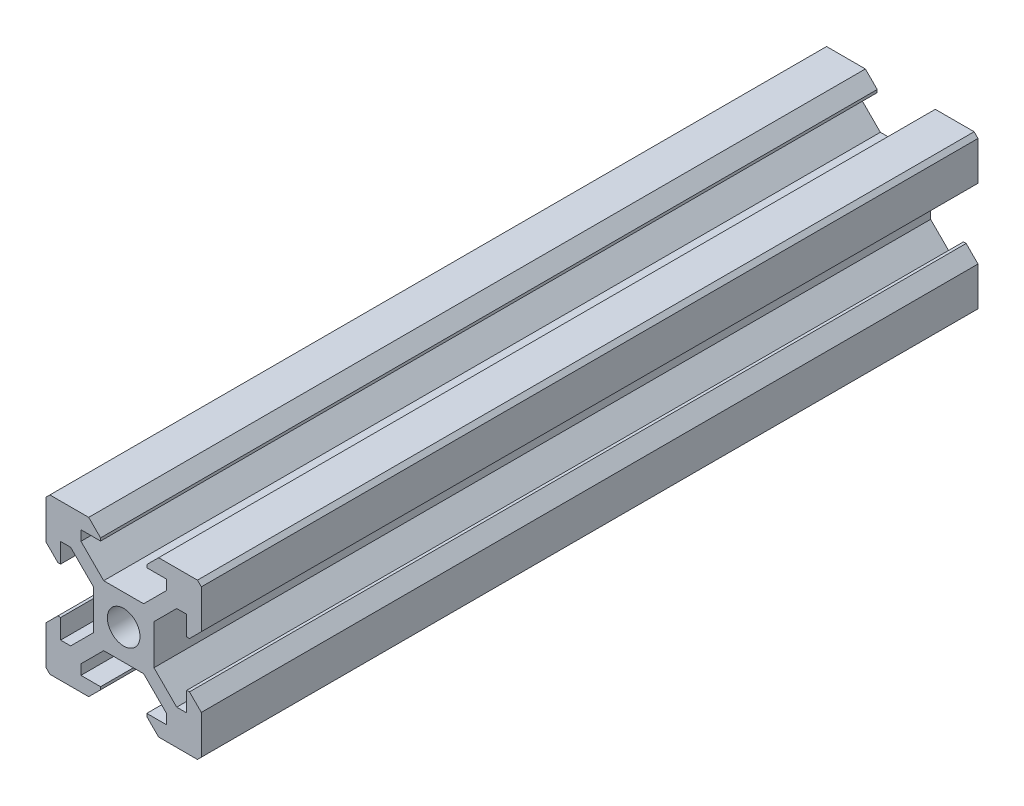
ISO-10303-21;
HEADER;
FILE_DESCRIPTION(('STEP AP214'),'2;1');
FILE_NAME('part.step','',(''),(''),'','','');
FILE_SCHEMA(('AUTOMOTIVE_DESIGN { 1 0 10303 214 1 1 1 1 }'));
ENDSEC;
DATA;
#1=APPLICATION_CONTEXT('core data for automotive mechanical design processes');
#2=APPLICATION_PROTOCOL_DEFINITION('international standard','automotive_design',2000,#1);
#3=PRODUCT_CONTEXT('',#1,'mechanical');
#4=PRODUCT('Part','Part','',(#3));
#5=PRODUCT_RELATED_PRODUCT_CATEGORY('part','',(#4));
#6=PRODUCT_DEFINITION_FORMATION('','',#4);
#7=PRODUCT_DEFINITION_CONTEXT('part definition',#1,'design');
#8=PRODUCT_DEFINITION('design','',#6,#7);
#9=PRODUCT_DEFINITION_SHAPE('','',#8);
#10=(LENGTH_UNIT() NAMED_UNIT(*) SI_UNIT(.MILLI.,.METRE.));
#11=(NAMED_UNIT(*) PLANE_ANGLE_UNIT() SI_UNIT($,.RADIAN.));
#12=(NAMED_UNIT(*) SI_UNIT($,.STERADIAN.) SOLID_ANGLE_UNIT());
#13=UNCERTAINTY_MEASURE_WITH_UNIT(LENGTH_MEASURE(1.E-05),#10,'distance_accuracy_value','');
#14=(GEOMETRIC_REPRESENTATION_CONTEXT(3) GLOBAL_UNCERTAINTY_ASSIGNED_CONTEXT((#13)) GLOBAL_UNIT_ASSIGNED_CONTEXT((#10,
#11,#12)) REPRESENTATION_CONTEXT('',''));
#15=CARTESIAN_POINT('',(0.,0.,0.));
#16=DIRECTION('',(0.,0.,1.));
#17=DIRECTION('',(1.,0.,0.));
#18=AXIS2_PLACEMENT_3D('',#15,#16,#17);
#19=CARTESIAN_POINT('',(10.0000000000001,10.,100.));
#20=DIRECTION('',(0.,-1.,0.));
#21=DIRECTION('',(0.,0.,-1.));
#22=AXIS2_PLACEMENT_3D('',#19,#20,#21);
#23=PLANE('',#22);
#24=DIRECTION('',(-1.,0.,0.));
#25=VECTOR('',#24,1.);
#26=CARTESIAN_POINT('',(10.0000000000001,10.,100.));
#27=LINE('',#26,#25);
#28=CARTESIAN_POINT('',(9.5000000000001,10.,100.));
#29=VERTEX_POINT('',#28);
#30=CARTESIAN_POINT('',(4.5,10.,100.));
#31=VERTEX_POINT('',#30);
#32=EDGE_CURVE('E942',#29,#31,#27,.T.);
#33=ORIENTED_EDGE('',*,*,#32,.F.);
#34=DIRECTION('',(0.,0.,-1.));
#35=VECTOR('',#34,1.);
#36=CARTESIAN_POINT('',(9.5000000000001,10.,100.));
#37=LINE('',#36,#35);
#38=CARTESIAN_POINT('',(9.5000000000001,10.,0.));
#39=VERTEX_POINT('',#38);
#40=EDGE_CURVE('E1016',#29,#39,#37,.T.);
#41=ORIENTED_EDGE('',*,*,#40,.T.);
#42=DIRECTION('',(-1.,0.,0.));
#43=VECTOR('',#42,1.);
#44=CARTESIAN_POINT('',(10.0000000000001,10.,0.));
#45=LINE('',#44,#43);
#46=CARTESIAN_POINT('',(4.5,10.,0.));
#47=VERTEX_POINT('',#46);
#48=EDGE_CURVE('E941',#39,#47,#45,.T.);
#49=ORIENTED_EDGE('',*,*,#48,.T.);
#50=DIRECTION('',(0.,0.,-1.));
#51=VECTOR('',#50,1.);
#52=CARTESIAN_POINT('',(4.5,10.,100.));
#53=LINE('',#52,#51);
#54=EDGE_CURVE('E999',#31,#47,#53,.T.);
#55=ORIENTED_EDGE('',*,*,#54,.F.);
#56=EDGE_LOOP('',(#33,#41,#49,#55));
#57=FACE_BOUND('',#56,.T.);
#58=ADVANCED_FACE('F42',(#57),#23,.F.);
#59=CARTESIAN_POINT('',(2.61999999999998,8.12,100.));
#60=DIRECTION('',(0.707106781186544,-0.707106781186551,0.));
#61=DIRECTION('',(0.707106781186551,0.707106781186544,0.));
#62=AXIS2_PLACEMENT_3D('',#59,#60,#61);
#63=PLANE('',#62);
#64=DIRECTION('',(-0.707106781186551,-0.707106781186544,0.));
#65=VECTOR('',#64,1.);
#66=CARTESIAN_POINT('',(2.61999999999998,8.12,0.));
#67=LINE('',#66,#65);
#68=CARTESIAN_POINT('',(2.97355339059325,8.47355339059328,0.));
#69=VERTEX_POINT('',#68);
#70=EDGE_CURVE('E969',#47,#69,#67,.T.);
#71=ORIENTED_EDGE('',*,*,#70,.T.);
#72=DIRECTION('',(0.,0.,1.));
#73=VECTOR('',#72,1.);
#74=CARTESIAN_POINT('',(2.97355339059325,8.47355339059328,100.));
#75=LINE('',#74,#73);
#76=CARTESIAN_POINT('',(2.97355339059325,8.47355339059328,100.));
#77=VERTEX_POINT('',#76);
#78=EDGE_CURVE('E1010',#69,#77,#75,.T.);
#79=ORIENTED_EDGE('',*,*,#78,.T.);
#80=DIRECTION('',(-0.707106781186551,-0.707106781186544,0.));
#81=VECTOR('',#80,1.);
#82=CARTESIAN_POINT('',(2.61999999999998,8.12,100.));
#83=LINE('',#82,#81);
#84=EDGE_CURVE('E945',#31,#77,#83,.T.);
#85=ORIENTED_EDGE('',*,*,#84,.F.);
#86=ORIENTED_EDGE('',*,*,#54,.T.);
#87=EDGE_LOOP('',(#71,#79,#85,#86));
#88=FACE_BOUND('',#87,.T.);
#89=ADVANCED_FACE('F1034',(#88),#63,.F.);
#90=CARTESIAN_POINT('',(5.5,8.12,100.));
#91=DIRECTION('',(0.,1.,0.));
#92=DIRECTION('',(0.,0.,1.));
#93=AXIS2_PLACEMENT_3D('',#90,#91,#92);
#94=PLANE('',#93);
#95=DIRECTION('',(1.,0.,0.));
#96=VECTOR('',#95,1.);
#97=CARTESIAN_POINT('',(5.5,8.12,100.));
#98=LINE('',#97,#96);
#99=CARTESIAN_POINT('',(2.97355339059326,8.12,100.));
#100=VERTEX_POINT('',#99);
#101=CARTESIAN_POINT('',(5.5,8.12,100.));
#102=VERTEX_POINT('',#101);
#103=EDGE_CURVE('E950',#100,#102,#98,.T.);
#104=ORIENTED_EDGE('',*,*,#103,.F.);
#105=DIRECTION('',(0.,0.,-1.));
#106=VECTOR('',#105,1.);
#107=CARTESIAN_POINT('',(2.97355339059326,8.12,100.));
#108=LINE('',#107,#106);
#109=CARTESIAN_POINT('',(2.97355339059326,8.12,0.));
#110=VERTEX_POINT('',#109);
#111=EDGE_CURVE('E1003',#100,#110,#108,.T.);
#112=ORIENTED_EDGE('',*,*,#111,.T.);
#113=DIRECTION('',(1.,0.,0.));
#114=VECTOR('',#113,1.);
#115=CARTESIAN_POINT('',(5.5,8.12,0.));
#116=LINE('',#115,#114);
#117=CARTESIAN_POINT('',(5.5,8.12,0.));
#118=VERTEX_POINT('',#117);
#119=EDGE_CURVE('E973',#110,#118,#116,.T.);
#120=ORIENTED_EDGE('',*,*,#119,.T.);
#121=DIRECTION('',(0.,0.,-1.));
#122=VECTOR('',#121,1.);
#123=CARTESIAN_POINT('',(5.5,8.12,100.));
#124=LINE('',#123,#122);
#125=EDGE_CURVE('E995',#102,#118,#124,.T.);
#126=ORIENTED_EDGE('',*,*,#125,.F.);
#127=EDGE_LOOP('',(#104,#112,#120,#126));
#128=FACE_BOUND('',#127,.T.);
#129=ADVANCED_FACE('F1041',(#128),#94,.F.);
#130=CARTESIAN_POINT('',(5.5,6.82936074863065,100.));
#131=DIRECTION('',(1.,0.,0.));
#132=DIRECTION('',(0.,0.,-1.));
#133=AXIS2_PLACEMENT_3D('',#130,#131,#132);
#134=PLANE('',#133);
#135=DIRECTION('',(0.,-1.,0.));
#136=VECTOR('',#135,1.);
#137=CARTESIAN_POINT('',(5.5,6.82936074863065,0.));
#138=LINE('',#137,#136);
#139=CARTESIAN_POINT('',(5.5,6.82936074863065,0.));
#140=VERTEX_POINT('',#139);
#141=EDGE_CURVE('E976',#118,#140,#138,.T.);
#142=ORIENTED_EDGE('',*,*,#141,.T.);
#143=DIRECTION('',(0.,0.,-1.));
#144=VECTOR('',#143,1.);
#145=CARTESIAN_POINT('',(5.5,6.82936074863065,100.));
#146=LINE('',#145,#144);
#147=CARTESIAN_POINT('',(5.5,6.82936074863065,100.));
#148=VERTEX_POINT('',#147);
#149=EDGE_CURVE('E991',#148,#140,#146,.T.);
#150=ORIENTED_EDGE('',*,*,#149,.F.);
#151=DIRECTION('',(0.,-1.,0.));
#152=VECTOR('',#151,1.);
#153=CARTESIAN_POINT('',(5.5,6.82936074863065,100.));
#154=LINE('',#153,#152);
#155=EDGE_CURVE('E953',#102,#148,#154,.T.);
#156=ORIENTED_EDGE('',*,*,#155,.F.);
#157=ORIENTED_EDGE('',*,*,#125,.T.);
#158=EDGE_LOOP('',(#142,#150,#156,#157));
#159=FACE_BOUND('',#158,.T.);
#160=ADVANCED_FACE('F1048',(#159),#134,.F.);
#161=CARTESIAN_POINT('',(5.5,6.82936074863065,100.));
#162=DIRECTION('',(0.707106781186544,-0.707106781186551,0.));
#163=DIRECTION('',(0.707106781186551,0.707106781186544,0.));
#164=AXIS2_PLACEMENT_3D('',#161,#162,#163);
#165=PLANE('',#164);
#166=DIRECTION('',(-0.707106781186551,-0.707106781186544,0.));
#167=VECTOR('',#166,1.);
#168=CARTESIAN_POINT('',(5.5,6.82936074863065,0.));
#169=LINE('',#168,#167);
#170=CARTESIAN_POINT('',(2.57063925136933,3.90000000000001,0.));
#171=VERTEX_POINT('',#170);
#172=EDGE_CURVE('E979',#140,#171,#169,.T.);
#173=ORIENTED_EDGE('',*,*,#172,.T.);
#174=DIRECTION('',(0.,0.,-1.));
#175=VECTOR('',#174,1.);
#176=CARTESIAN_POINT('',(2.57063925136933,3.90000000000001,100.));
#177=LINE('',#176,#175);
#178=CARTESIAN_POINT('',(2.57063925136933,3.90000000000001,100.));
#179=VERTEX_POINT('',#178);
#180=EDGE_CURVE('E966',#179,#171,#177,.T.);
#181=ORIENTED_EDGE('',*,*,#180,.F.);
#182=DIRECTION('',(-0.707106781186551,-0.707106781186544,0.));
#183=VECTOR('',#182,1.);
#184=CARTESIAN_POINT('',(5.5,6.82936074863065,100.));
#185=LINE('',#184,#183);
#186=EDGE_CURVE('E956',#148,#179,#185,.T.);
#187=ORIENTED_EDGE('',*,*,#186,.F.);
#188=ORIENTED_EDGE('',*,*,#149,.T.);
#189=EDGE_LOOP('',(#173,#181,#187,#188));
#190=FACE_BOUND('',#189,.T.);
#191=ADVANCED_FACE('F1052',(#190),#165,.F.);
#192=CARTESIAN_POINT('',(0.,3.90000000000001,100.));
#193=DIRECTION('',(0.,-1.,0.));
#194=DIRECTION('',(1.,0.,0.));
#195=AXIS2_PLACEMENT_3D('',#192,#193,#194);
#196=PLANE('',#195);
#197=DIRECTION('',(-1.,0.,0.));
#198=VECTOR('',#197,1.);
#199=CARTESIAN_POINT('',(0.,3.90000000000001,0.));
#200=LINE('',#199,#198);
#201=CARTESIAN_POINT('',(-2.57063925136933,3.90000000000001,0.));
#202=VERTEX_POINT('',#201);
#203=EDGE_CURVE('E982',#171,#202,#200,.T.);
#204=ORIENTED_EDGE('',*,*,#203,.T.);
#205=DIRECTION('',(0.,0.,-1.));
#206=VECTOR('',#205,1.);
#207=CARTESIAN_POINT('',(-2.57063925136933,3.90000000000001,100.));
#208=LINE('',#207,#206);
#209=CARTESIAN_POINT('',(-2.57063925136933,3.90000000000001,100.));
#210=VERTEX_POINT('',#209);
#211=EDGE_CURVE('E805',#210,#202,#208,.T.);
#212=ORIENTED_EDGE('',*,*,#211,.F.);
#213=DIRECTION('',(-1.,0.,0.));
#214=VECTOR('',#213,1.);
#215=CARTESIAN_POINT('',(0.,3.90000000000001,100.));
#216=LINE('',#215,#214);
#217=EDGE_CURVE('E959',#179,#210,#216,.T.);
#218=ORIENTED_EDGE('',*,*,#217,.F.);
#219=ORIENTED_EDGE('',*,*,#180,.T.);
#220=EDGE_LOOP('',(#204,#212,#218,#219));
#221=FACE_BOUND('',#220,.T.);
#222=ADVANCED_FACE('F1058',(#221),#196,.F.);
#223=CARTESIAN_POINT('',(0.,0.,100.));
#224=DIRECTION('',(0.,0.,-1.));
#225=DIRECTION('',(-1.,0.,0.));
#226=AXIS2_PLACEMENT_3D('',#223,#224,#225);
#227=CYLINDRICAL_SURFACE('',#226,2.1);
#228=CARTESIAN_POINT('',(0.,0.,0.));
#229=DIRECTION('',(0.,0.,-1.));
#230=DIRECTION('',(1.,0.,0.));
#231=AXIS2_PLACEMENT_3D('',#228,#229,#230);
#232=CIRCLE('',#231,2.1);
#233=CARTESIAN_POINT('',(-2.1,0.,0.));
#234=VERTEX_POINT('',#233);
#235=EDGE_CURVE('E946',#234,#234,#232,.T.);
#236=CARTESIAN_POINT('',(0.,0.,100.));
#237=DIRECTION('',(0.,0.,-1.));
#238=DIRECTION('',(1.,0.,0.));
#239=AXIS2_PLACEMENT_3D('',#236,#237,#238);
#240=CIRCLE('',#239,2.1);
#241=CARTESIAN_POINT('',(-2.1,0.,100.));
#242=VERTEX_POINT('',#241);
#243=EDGE_CURVE('E962',#242,#242,#240,.T.);
#244=CARTESIAN_POINT('',(-2.1,0.,0.));
#245=CARTESIAN_POINT('',(-2.1,0.,1.04166666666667));
#246=CARTESIAN_POINT('',(-2.1,0.,2.08333333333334));
#247=CARTESIAN_POINT('',(-2.1,0.,4.16666666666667));
#248=CARTESIAN_POINT('',(-2.1,0.,5.20833333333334));
#249=CARTESIAN_POINT('',(-2.1,0.,7.29166666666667));
#250=CARTESIAN_POINT('',(-2.1,0.,8.33333333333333));
#251=CARTESIAN_POINT('',(-2.1,0.,10.4166666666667));
#252=CARTESIAN_POINT('',(-2.1,0.,11.4583333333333));
#253=CARTESIAN_POINT('',(-2.1,0.,13.5416666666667));
#254=CARTESIAN_POINT('',(-2.1,0.,14.5833333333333));
#255=CARTESIAN_POINT('',(-2.1,0.,16.6666666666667));
#256=CARTESIAN_POINT('',(-2.1,0.,17.7083333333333));
#257=CARTESIAN_POINT('',(-2.1,0.,19.7916666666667));
#258=CARTESIAN_POINT('',(-2.1,0.,20.8333333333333));
#259=CARTESIAN_POINT('',(-2.1,0.,22.9166666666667));
#260=CARTESIAN_POINT('',(-2.1,0.,23.9583333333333));
#261=CARTESIAN_POINT('',(-2.1,0.,26.0416666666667));
#262=CARTESIAN_POINT('',(-2.1,0.,27.0833333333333));
#263=CARTESIAN_POINT('',(-2.1,0.,29.1666666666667));
#264=CARTESIAN_POINT('',(-2.1,0.,30.2083333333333));
#265=CARTESIAN_POINT('',(-2.1,0.,32.2916666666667));
#266=CARTESIAN_POINT('',(-2.1,0.,33.3333333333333));
#267=CARTESIAN_POINT('',(-2.1,0.,35.4166666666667));
#268=CARTESIAN_POINT('',(-2.1,0.,36.4583333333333));
#269=CARTESIAN_POINT('',(-2.1,0.,38.5416666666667));
#270=CARTESIAN_POINT('',(-2.1,0.,39.5833333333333));
#271=CARTESIAN_POINT('',(-2.1,0.,41.6666666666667));
#272=CARTESIAN_POINT('',(-2.1,0.,42.7083333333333));
#273=CARTESIAN_POINT('',(-2.1,0.,44.7916666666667));
#274=CARTESIAN_POINT('',(-2.1,0.,45.8333333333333));
#275=CARTESIAN_POINT('',(-2.1,0.,47.9166666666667));
#276=CARTESIAN_POINT('',(-2.1,0.,48.9583333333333));
#277=CARTESIAN_POINT('',(-2.1,0.,51.0416666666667));
#278=CARTESIAN_POINT('',(-2.1,0.,52.0833333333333));
#279=CARTESIAN_POINT('',(-2.1,0.,54.1666666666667));
#280=CARTESIAN_POINT('',(-2.1,0.,55.2083333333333));
#281=CARTESIAN_POINT('',(-2.1,0.,57.2916666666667));
#282=CARTESIAN_POINT('',(-2.1,0.,58.3333333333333));
#283=CARTESIAN_POINT('',(-2.1,0.,60.4166666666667));
#284=CARTESIAN_POINT('',(-2.1,0.,61.4583333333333));
#285=CARTESIAN_POINT('',(-2.1,0.,63.5416666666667));
#286=CARTESIAN_POINT('',(-2.1,0.,64.5833333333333));
#287=CARTESIAN_POINT('',(-2.1,0.,66.6666666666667));
#288=CARTESIAN_POINT('',(-2.1,0.,67.7083333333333));
#289=CARTESIAN_POINT('',(-2.1,0.,69.7916666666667));
#290=CARTESIAN_POINT('',(-2.1,0.,70.8333333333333));
#291=CARTESIAN_POINT('',(-2.1,0.,72.9166666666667));
#292=CARTESIAN_POINT('',(-2.1,0.,73.9583333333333));
#293=CARTESIAN_POINT('',(-2.1,0.,76.0416666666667));
#294=CARTESIAN_POINT('',(-2.1,0.,77.0833333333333));
#295=CARTESIAN_POINT('',(-2.1,0.,79.1666666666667));
#296=CARTESIAN_POINT('',(-2.1,0.,80.2083333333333));
#297=CARTESIAN_POINT('',(-2.1,0.,82.2916666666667));
#298=CARTESIAN_POINT('',(-2.1,0.,83.3333333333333));
#299=CARTESIAN_POINT('',(-2.1,0.,85.4166666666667));
#300=CARTESIAN_POINT('',(-2.1,0.,86.4583333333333));
#301=CARTESIAN_POINT('',(-2.1,0.,88.5416666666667));
#302=CARTESIAN_POINT('',(-2.1,0.,89.5833333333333));
#303=CARTESIAN_POINT('',(-2.1,0.,91.6666666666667));
#304=CARTESIAN_POINT('',(-2.1,0.,92.7083333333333));
#305=CARTESIAN_POINT('',(-2.1,0.,94.7916666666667));
#306=CARTESIAN_POINT('',(-2.1,0.,95.8333333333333));
#307=CARTESIAN_POINT('',(-2.1,0.,97.9166666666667));
#308=CARTESIAN_POINT('',(-2.1,0.,98.9583333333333));
#309=CARTESIAN_POINT('',(-2.1,0.,100.));
#310=B_SPLINE_CURVE_WITH_KNOTS('',3,(#244,#245,#246,#247,#248,#249,#250,#251,#252,#253,#254,
#255,#256,#257,#258,#259,#260,#261,#262,#263,#264,#265,#266,#267,#268,#269,#270,#271,#272,#273,
#274,#275,#276,#277,#278,#279,#280,#281,#282,#283,#284,#285,#286,#287,#288,#289,#290,#291,#292,
#293,#294,#295,#296,#297,#298,#299,#300,#301,#302,#303,#304,#305,#306,#307,#308,#309),
.UNSPECIFIED.,.F.,.F.,(4,2,2,2,2,2,2,2,2,2,2,2,2,2,2,2,2,2,2,2,2,2,2,2,2,2,2,2,2,2,2,2,4),(0.,
3.125,6.25000000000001,9.37499999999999,12.5,15.625,18.75,21.875,25.,28.125,31.25,34.375,37.5,
40.625,43.75,46.875,50.,53.125,56.25,59.375,62.5,65.625,68.75,71.875,75.,78.125,81.25,84.375,
87.5,90.625,93.75,96.875,100.),.UNSPECIFIED.);
#311=EDGE_CURVE('BSEAM1258',#234,#242,#310,.T.);
#312=ORIENTED_EDGE('',*,*,#235,.T.);
#313=ORIENTED_EDGE('',*,*,#243,.F.);
#314=ORIENTED_EDGE('',*,*,#311,.T.);
#315=ORIENTED_EDGE('',*,*,#311,.F.);
#316=EDGE_LOOP('',(#312,#314,#313,#315));
#317=FACE_BOUND('',#316,.T.);
#318=ADVANCED_FACE('F1258',(#317),#227,.F.);
#319=CARTESIAN_POINT('',(0.,0.,100.));
#320=DIRECTION('',(0.,0.,1.));
#321=DIRECTION('',(1.,0.,0.));
#322=AXIS2_PLACEMENT_3D('',#319,#320,#321);
#323=PLANE('',#322);
#324=ORIENTED_EDGE('',*,*,#243,.T.);
#325=EDGE_LOOP('',(#324));
#326=FACE_BOUND('',#325,.T.);
#327=DIRECTION('',(0.,-1.,0.));
#328=VECTOR('',#327,1.);
#329=CARTESIAN_POINT('',(10.0000000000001,10.,100.));
#330=LINE('',#329,#328);
#331=CARTESIAN_POINT('',(10.0000000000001,9.50000000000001,100.));
#332=VERTEX_POINT('',#331);
#333=CARTESIAN_POINT('',(10.,4.4999999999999,100.));
#334=VERTEX_POINT('',#333);
#335=EDGE_CURVE('E868',#332,#334,#330,.T.);
#336=ORIENTED_EDGE('',*,*,#335,.F.);
#337=DIRECTION('',(0.707106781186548,-0.707106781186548,0.));
#338=VECTOR('',#337,1.);
#339=CARTESIAN_POINT('',(9.75000000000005,9.75000000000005,100.));
#340=LINE('',#339,#338);
#341=EDGE_CURVE('E11',#332,#29,#340,.F.);
#342=ORIENTED_EDGE('',*,*,#341,.T.);
#343=ORIENTED_EDGE('',*,*,#32,.T.);
#344=ORIENTED_EDGE('',*,*,#84,.T.);
#345=DIRECTION('',(0.,1.,0.));
#346=VECTOR('',#345,1.);
#347=CARTESIAN_POINT('',(2.97355339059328,0.,100.));
#348=LINE('',#347,#346);
#349=EDGE_CURVE('E1013',#77,#100,#348,.F.);
#350=ORIENTED_EDGE('',*,*,#349,.T.);
#351=ORIENTED_EDGE('',*,*,#103,.T.);
#352=ORIENTED_EDGE('',*,*,#155,.T.);
#353=ORIENTED_EDGE('',*,*,#186,.T.);
#354=ORIENTED_EDGE('',*,*,#217,.T.);
#355=DIRECTION('',(0.707106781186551,-0.707106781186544,0.));
#356=VECTOR('',#355,1.);
#357=CARTESIAN_POINT('',(-5.5,6.82936074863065,100.));
#358=LINE('',#357,#356);
#359=CARTESIAN_POINT('',(-5.5,6.82936074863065,100.));
#360=VERTEX_POINT('',#359);
#361=EDGE_CURVE('E801',#360,#210,#358,.T.);
#362=ORIENTED_EDGE('',*,*,#361,.F.);
#363=DIRECTION('',(0.,-1.,0.));
#364=VECTOR('',#363,1.);
#365=CARTESIAN_POINT('',(-5.5,6.82936074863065,100.));
#366=LINE('',#365,#364);
#367=CARTESIAN_POINT('',(-5.5,8.12,100.));
#368=VERTEX_POINT('',#367);
#369=EDGE_CURVE('E797',#368,#360,#366,.T.);
#370=ORIENTED_EDGE('',*,*,#369,.F.);
#371=DIRECTION('',(-1.,0.,0.));
#372=VECTOR('',#371,1.);
#373=CARTESIAN_POINT('',(-5.5,8.12,100.));
#374=LINE('',#373,#372);
#375=CARTESIAN_POINT('',(-2.97355339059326,8.12,100.));
#376=VERTEX_POINT('',#375);
#377=EDGE_CURVE('E793',#376,#368,#374,.T.);
#378=ORIENTED_EDGE('',*,*,#377,.F.);
#379=DIRECTION('',(0.,1.,0.));
#380=VECTOR('',#379,1.);
#381=CARTESIAN_POINT('',(-2.97355339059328,0.,100.));
#382=LINE('',#381,#380);
#383=CARTESIAN_POINT('',(-2.97355339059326,8.47355339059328,100.));
#384=VERTEX_POINT('',#383);
#385=EDGE_CURVE('E850',#384,#376,#382,.F.);
#386=ORIENTED_EDGE('',*,*,#385,.F.);
#387=DIRECTION('',(0.707106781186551,-0.707106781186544,0.));
#388=VECTOR('',#387,1.);
#389=CARTESIAN_POINT('',(-2.61999999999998,8.12,100.));
#390=LINE('',#389,#388);
#391=CARTESIAN_POINT('',(-4.5,10.,100.));
#392=VERTEX_POINT('',#391);
#393=EDGE_CURVE('E788',#392,#384,#390,.T.);
#394=ORIENTED_EDGE('',*,*,#393,.F.);
#395=DIRECTION('',(1.,0.,0.));
#396=VECTOR('',#395,1.);
#397=CARTESIAN_POINT('',(-10.0000000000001,10.,100.));
#398=LINE('',#397,#396);
#399=CARTESIAN_POINT('',(-9.5000000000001,10.,100.));
#400=VERTEX_POINT('',#399);
#401=EDGE_CURVE('E784',#400,#392,#398,.T.);
#402=ORIENTED_EDGE('',*,*,#401,.F.);
#403=DIRECTION('',(-0.707106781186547,-0.707106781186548,0.));
#404=VECTOR('',#403,1.);
#405=CARTESIAN_POINT('',(-9.75000000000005,9.75000000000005,100.));
#406=LINE('',#405,#404);
#407=CARTESIAN_POINT('',(-10.0000000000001,9.5,100.));
#408=VERTEX_POINT('',#407);
#409=EDGE_CURVE('E864',#408,#400,#406,.F.);
#410=ORIENTED_EDGE('',*,*,#409,.F.);
#411=DIRECTION('',(0.,-1.,0.));
#412=VECTOR('',#411,1.);
#413=CARTESIAN_POINT('',(-10.0000000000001,10.,100.));
#414=LINE('',#413,#412);
#415=CARTESIAN_POINT('',(-10.0000000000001,4.49999999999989,100.));
#416=VERTEX_POINT('',#415);
#417=EDGE_CURVE('E712',#408,#416,#414,.T.);
#418=ORIENTED_EDGE('',*,*,#417,.T.);
#419=DIRECTION('',(0.707106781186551,-0.707106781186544,0.));
#420=VECTOR('',#419,1.);
#421=CARTESIAN_POINT('',(-8.12000000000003,2.61999999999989,100.));
#422=LINE('',#421,#420);
#423=CARTESIAN_POINT('',(-8.47355339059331,2.97355339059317,100.));
#424=VERTEX_POINT('',#423);
#425=EDGE_CURVE('E716',#416,#424,#422,.T.);
#426=ORIENTED_EDGE('',*,*,#425,.T.);
#427=DIRECTION('',(-1.,0.,0.));
#428=VECTOR('',#427,1.);
#429=CARTESIAN_POINT('',(0.,2.97355339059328,100.));
#430=LINE('',#429,#428);
#431=CARTESIAN_POINT('',(-8.12000000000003,2.97355339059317,100.));
#432=VERTEX_POINT('',#431);
#433=EDGE_CURVE('E779',#424,#432,#430,.F.);
#434=ORIENTED_EDGE('',*,*,#433,.T.);
#435=DIRECTION('',(0.,1.,0.));
#436=VECTOR('',#435,1.);
#437=CARTESIAN_POINT('',(-8.12000000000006,5.49999999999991,100.));
#438=LINE('',#437,#436);
#439=CARTESIAN_POINT('',(-8.12000000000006,5.49999999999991,100.));
#440=VERTEX_POINT('',#439);
#441=EDGE_CURVE('E721',#432,#440,#438,.T.);
#442=ORIENTED_EDGE('',*,*,#441,.T.);
#443=DIRECTION('',(1.,0.,0.));
#444=VECTOR('',#443,1.);
#445=CARTESIAN_POINT('',(-6.82936074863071,5.49999999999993,100.));
#446=LINE('',#445,#444);
#447=CARTESIAN_POINT('',(-6.82936074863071,5.49999999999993,100.));
#448=VERTEX_POINT('',#447);
#449=EDGE_CURVE('E725',#440,#448,#446,.T.);
#450=ORIENTED_EDGE('',*,*,#449,.T.);
#451=DIRECTION('',(0.707106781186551,-0.707106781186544,0.));
#452=VECTOR('',#451,1.);
#453=CARTESIAN_POINT('',(-6.82936074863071,5.49999999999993,100.));
#454=LINE('',#453,#452);
#455=CARTESIAN_POINT('',(-3.90000000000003,2.57063925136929,100.));
#456=VERTEX_POINT('',#455);
#457=EDGE_CURVE('E729',#448,#456,#454,.T.);
#458=ORIENTED_EDGE('',*,*,#457,.T.);
#459=DIRECTION('',(0.,-1.,0.));
#460=VECTOR('',#459,1.);
#461=CARTESIAN_POINT('',(-3.90000000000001,0.,100.));
#462=LINE('',#461,#460);
#463=CARTESIAN_POINT('',(-3.89999999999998,-2.57063925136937,100.));
#464=VERTEX_POINT('',#463);
#465=EDGE_CURVE('E733',#456,#464,#462,.T.);
#466=ORIENTED_EDGE('',*,*,#465,.T.);
#467=DIRECTION('',(0.707106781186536,0.707106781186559,0.));
#468=VECTOR('',#467,1.);
#469=CARTESIAN_POINT('',(-6.82936074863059,-5.50000000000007,100.));
#470=LINE('',#469,#468);
#471=CARTESIAN_POINT('',(-6.82936074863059,-5.50000000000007,100.));
#472=VERTEX_POINT('',#471);
#473=EDGE_CURVE('E435',#472,#464,#470,.T.);
#474=ORIENTED_EDGE('',*,*,#473,.F.);
#475=DIRECTION('',(1.,0.,0.));
#476=VECTOR('',#475,1.);
#477=CARTESIAN_POINT('',(-6.82936074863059,-5.50000000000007,100.));
#478=LINE('',#477,#476);
#479=CARTESIAN_POINT('',(-8.11999999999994,-5.50000000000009,100.));
#480=VERTEX_POINT('',#479);
#481=EDGE_CURVE('E429',#480,#472,#478,.T.);
#482=ORIENTED_EDGE('',*,*,#481,.F.);
#483=DIRECTION('',(0.,-1.,0.));
#484=VECTOR('',#483,1.);
#485=CARTESIAN_POINT('',(-8.11999999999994,-5.50000000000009,100.));
#486=LINE('',#485,#484);
#487=CARTESIAN_POINT('',(-8.11999999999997,-2.97355339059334,100.));
#488=VERTEX_POINT('',#487);
#489=EDGE_CURVE('E425',#488,#480,#486,.T.);
#490=ORIENTED_EDGE('',*,*,#489,.F.);
#491=DIRECTION('',(-1.,0.,0.));
#492=VECTOR('',#491,1.);
#493=CARTESIAN_POINT('',(0.,-2.97355339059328,100.));
#494=LINE('',#493,#492);
#495=CARTESIAN_POINT('',(-8.47355339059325,-2.97355339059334,100.));
#496=VERTEX_POINT('',#495);
#497=EDGE_CURVE('E423',#496,#488,#494,.F.);
#498=ORIENTED_EDGE('',*,*,#497,.F.);
#499=DIRECTION('',(0.707106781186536,0.707106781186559,0.));
#500=VECTOR('',#499,1.);
#501=CARTESIAN_POINT('',(-8.11999999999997,-2.62000000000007,100.));
#502=LINE('',#501,#500);
#503=CARTESIAN_POINT('',(-9.99999999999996,-4.50000000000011,100.));
#504=VERTEX_POINT('',#503);
#505=EDGE_CURVE('E399',#504,#496,#502,.T.);
#506=ORIENTED_EDGE('',*,*,#505,.F.);
#507=DIRECTION('',(0.,1.,0.));
#508=VECTOR('',#507,1.);
#509=CARTESIAN_POINT('',(-9.9999999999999,-10.0000000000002,100.));
#510=LINE('',#509,#508);
#511=CARTESIAN_POINT('',(-9.9999999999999,-9.50000000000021,100.));
#512=VERTEX_POINT('',#511);
#513=EDGE_CURVE('E411',#512,#504,#510,.T.);
#514=ORIENTED_EDGE('',*,*,#513,.F.);
#515=DIRECTION('',(-0.707106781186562,0.707106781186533,0.));
#516=VECTOR('',#515,1.);
#517=CARTESIAN_POINT('',(-9.74999999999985,-9.75000000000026,100.));
#518=LINE('',#517,#516);
#519=CARTESIAN_POINT('',(-9.49999999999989,-10.0000000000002,100.));
#520=VERTEX_POINT('',#519);
#521=EDGE_CURVE('E549',#512,#520,#518,.F.);
#522=ORIENTED_EDGE('',*,*,#521,.T.);
#523=DIRECTION('',(1.,0.,0.));
#524=VECTOR('',#523,1.);
#525=CARTESIAN_POINT('',(-9.9999999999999,-10.0000000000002,100.));
#526=LINE('',#525,#524);
#527=CARTESIAN_POINT('',(-4.49999999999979,-10.0000000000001,100.));
#528=VERTEX_POINT('',#527);
#529=EDGE_CURVE('E476',#520,#528,#526,.T.);
#530=ORIENTED_EDGE('',*,*,#529,.T.);
#531=DIRECTION('',(0.707106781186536,0.707106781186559,0.));
#532=VECTOR('',#531,1.);
#533=CARTESIAN_POINT('',(-2.61999999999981,-8.12000000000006,100.));
#534=LINE('',#533,#532);
#535=CARTESIAN_POINT('',(-2.97355339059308,-8.47355339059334,100.));
#536=VERTEX_POINT('',#535);
#537=EDGE_CURVE('E480',#528,#536,#534,.T.);
#538=ORIENTED_EDGE('',*,*,#537,.T.);
#539=DIRECTION('',(0.,-1.,0.));
#540=VECTOR('',#539,1.);
#541=CARTESIAN_POINT('',(-2.97355339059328,0.,100.));
#542=LINE('',#541,#540);
#543=CARTESIAN_POINT('',(-2.97355339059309,-8.12000000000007,100.));
#544=VERTEX_POINT('',#543);
#545=EDGE_CURVE('E536',#536,#544,#542,.F.);
#546=ORIENTED_EDGE('',*,*,#545,.T.);
#547=DIRECTION('',(-1.,0.,0.));
#548=VECTOR('',#547,1.);
#549=CARTESIAN_POINT('',(-5.49999999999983,-8.12000000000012,100.));
#550=LINE('',#549,#548);
#551=CARTESIAN_POINT('',(-5.49999999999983,-8.12000000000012,100.));
#552=VERTEX_POINT('',#551);
#553=EDGE_CURVE('E485',#544,#552,#550,.T.);
#554=ORIENTED_EDGE('',*,*,#553,.T.);
#555=DIRECTION('',(0.,1.,0.));
#556=VECTOR('',#555,1.);
#557=CARTESIAN_POINT('',(-5.49999999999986,-6.82936074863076,100.));
#558=LINE('',#557,#556);
#559=CARTESIAN_POINT('',(-5.49999999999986,-6.82936074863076,100.));
#560=VERTEX_POINT('',#559);
#561=EDGE_CURVE('E489',#552,#560,#558,.T.);
#562=ORIENTED_EDGE('',*,*,#561,.T.);
#563=DIRECTION('',(0.707106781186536,0.707106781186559,0.));
#564=VECTOR('',#563,1.);
#565=CARTESIAN_POINT('',(-5.49999999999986,-6.82936074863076,100.));
#566=LINE('',#565,#564);
#567=CARTESIAN_POINT('',(-2.57063925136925,-3.90000000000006,100.));
#568=VERTEX_POINT('',#567);
#569=EDGE_CURVE('E493',#560,#568,#566,.T.);
#570=ORIENTED_EDGE('',*,*,#569,.T.);
#571=DIRECTION('',(-1.,0.,0.));
#572=VECTOR('',#571,1.);
#573=CARTESIAN_POINT('',(0.,-3.90000000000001,100.));
#574=LINE('',#573,#572);
#575=CARTESIAN_POINT('',(2.57063925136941,-3.89999999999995,100.));
#576=VERTEX_POINT('',#575);
#577=EDGE_CURVE('E641',#576,#568,#574,.T.);
#578=ORIENTED_EDGE('',*,*,#577,.F.);
#579=DIRECTION('',(-0.707106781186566,0.707106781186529,0.));
#580=VECTOR('',#579,1.);
#581=CARTESIAN_POINT('',(5.50000000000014,-6.82936074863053,100.));
#582=LINE('',#581,#580);
#583=CARTESIAN_POINT('',(5.50000000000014,-6.82936074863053,100.));
#584=VERTEX_POINT('',#583);
#585=EDGE_CURVE('E637',#584,#576,#582,.T.);
#586=ORIENTED_EDGE('',*,*,#585,.F.);
#587=DIRECTION('',(0.,1.,0.));
#588=VECTOR('',#587,1.);
#589=CARTESIAN_POINT('',(5.50000000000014,-6.82936074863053,100.));
#590=LINE('',#589,#588);
#591=CARTESIAN_POINT('',(5.50000000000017,-8.11999999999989,100.));
#592=VERTEX_POINT('',#591);
#593=EDGE_CURVE('E633',#592,#584,#590,.T.);
#594=ORIENTED_EDGE('',*,*,#593,.F.);
#595=DIRECTION('',(1.,0.,0.));
#596=VECTOR('',#595,1.);
#597=CARTESIAN_POINT('',(5.50000000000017,-8.11999999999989,100.));
#598=LINE('',#597,#596);
#599=CARTESIAN_POINT('',(2.97355339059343,-8.11999999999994,100.));
#600=VERTEX_POINT('',#599);
#601=EDGE_CURVE('E629',#600,#592,#598,.T.);
#602=ORIENTED_EDGE('',*,*,#601,.F.);
#603=DIRECTION('',(0.,-1.,0.));
#604=VECTOR('',#603,1.);
#605=CARTESIAN_POINT('',(2.97355339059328,0.,100.));
#606=LINE('',#605,#604);
#607=CARTESIAN_POINT('',(2.97355339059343,-8.47355339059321,100.));
#608=VERTEX_POINT('',#607);
#609=EDGE_CURVE('E694',#608,#600,#606,.F.);
#610=ORIENTED_EDGE('',*,*,#609,.F.);
#611=DIRECTION('',(-0.707106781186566,0.707106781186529,0.));
#612=VECTOR('',#611,1.);
#613=CARTESIAN_POINT('',(2.62000000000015,-8.11999999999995,100.));
#614=LINE('',#613,#612);
#615=CARTESIAN_POINT('',(4.50000000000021,-9.99999999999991,100.));
#616=VERTEX_POINT('',#615);
#617=EDGE_CURVE('E624',#616,#608,#614,.T.);
#618=ORIENTED_EDGE('',*,*,#617,.F.);
#619=DIRECTION('',(-1.,0.,0.));
#620=VECTOR('',#619,1.);
#621=CARTESIAN_POINT('',(10.0000000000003,-9.99999999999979,100.));
#622=LINE('',#621,#620);
#623=CARTESIAN_POINT('',(9.50000000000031,-9.9999999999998,100.));
#624=VERTEX_POINT('',#623);
#625=EDGE_CURVE('E620',#624,#616,#622,.T.);
#626=ORIENTED_EDGE('',*,*,#625,.F.);
#627=DIRECTION('',(0.707106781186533,0.707106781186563,0.));
#628=VECTOR('',#627,1.);
#629=CARTESIAN_POINT('',(9.75000000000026,-9.74999999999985,100.));
#630=LINE('',#629,#628);
#631=CARTESIAN_POINT('',(10.0000000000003,-9.49999999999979,100.));
#632=VERTEX_POINT('',#631);
#633=EDGE_CURVE('E708',#632,#624,#630,.F.);
#634=ORIENTED_EDGE('',*,*,#633,.F.);
#635=DIRECTION('',(0.,1.,0.));
#636=VECTOR('',#635,1.);
#637=CARTESIAN_POINT('',(10.0000000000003,-9.99999999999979,100.));
#638=LINE('',#637,#636);
#639=CARTESIAN_POINT('',(10.0000000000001,-4.49999999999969,100.));
#640=VERTEX_POINT('',#639);
#641=EDGE_CURVE('E553',#632,#640,#638,.T.);
#642=ORIENTED_EDGE('',*,*,#641,.T.);
#643=DIRECTION('',(-0.707106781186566,0.707106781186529,0.));
#644=VECTOR('',#643,1.);
#645=CARTESIAN_POINT('',(8.12000000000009,-2.61999999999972,100.));
#646=LINE('',#645,#644);
#647=CARTESIAN_POINT('',(8.47355339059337,-2.97355339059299,100.));
#648=VERTEX_POINT('',#647);
#649=EDGE_CURVE('E557',#640,#648,#646,.T.);
#650=ORIENTED_EDGE('',*,*,#649,.T.);
#651=DIRECTION('',(1.,0.,0.));
#652=VECTOR('',#651,1.);
#653=CARTESIAN_POINT('',(0.,-2.97355339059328,100.));
#654=LINE('',#653,#652);
#655=CARTESIAN_POINT('',(8.1200000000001,-2.973553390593,100.));
#656=VERTEX_POINT('',#655);
#657=EDGE_CURVE('E615',#648,#656,#654,.F.);
#658=ORIENTED_EDGE('',*,*,#657,.T.);
#659=DIRECTION('',(0.,-1.,0.));
#660=VECTOR('',#659,1.);
#661=CARTESIAN_POINT('',(8.12000000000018,-5.49999999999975,100.));
#662=LINE('',#661,#660);
#663=CARTESIAN_POINT('',(8.12000000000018,-5.49999999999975,100.));
#664=VERTEX_POINT('',#663);
#665=EDGE_CURVE('E562',#656,#664,#662,.T.);
#666=ORIENTED_EDGE('',*,*,#665,.T.);
#667=DIRECTION('',(-1.,0.,0.));
#668=VECTOR('',#667,1.);
#669=CARTESIAN_POINT('',(6.82936074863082,-5.49999999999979,100.));
#670=LINE('',#669,#668);
#671=CARTESIAN_POINT('',(6.82936074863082,-5.49999999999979,100.));
#672=VERTEX_POINT('',#671);
#673=EDGE_CURVE('E566',#664,#672,#670,.T.);
#674=ORIENTED_EDGE('',*,*,#673,.T.);
#675=DIRECTION('',(-0.707106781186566,0.707106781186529,0.));
#676=VECTOR('',#675,1.);
#677=CARTESIAN_POINT('',(6.82936074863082,-5.49999999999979,100.));
#678=LINE('',#677,#676);
#679=CARTESIAN_POINT('',(3.90000000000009,-2.57063925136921,100.));
#680=VERTEX_POINT('',#679);
#681=EDGE_CURVE('E570',#672,#680,#678,.T.);
#682=ORIENTED_EDGE('',*,*,#681,.T.);
#683=DIRECTION('',(0.,-1.,0.));
#684=VECTOR('',#683,1.);
#685=CARTESIAN_POINT('',(3.90000000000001,0.,100.));
#686=LINE('',#685,#684);
#687=CARTESIAN_POINT('',(3.90000000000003,2.57063925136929,100.));
#688=VERTEX_POINT('',#687);
#689=EDGE_CURVE('E888',#688,#680,#686,.T.);
#690=ORIENTED_EDGE('',*,*,#689,.F.);
#691=DIRECTION('',(-0.707106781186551,-0.707106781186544,0.));
#692=VECTOR('',#691,1.);
#693=CARTESIAN_POINT('',(6.8293607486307,5.49999999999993,100.));
#694=LINE('',#693,#692);
#695=CARTESIAN_POINT('',(6.8293607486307,5.49999999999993,100.));
#696=VERTEX_POINT('',#695);
#697=EDGE_CURVE('E884',#696,#688,#694,.T.);
#698=ORIENTED_EDGE('',*,*,#697,.F.);
#699=DIRECTION('',(-1.,0.,0.));
#700=VECTOR('',#699,1.);
#701=CARTESIAN_POINT('',(6.8293607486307,5.49999999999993,100.));
#702=LINE('',#701,#700);
#703=CARTESIAN_POINT('',(8.12000000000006,5.49999999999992,100.));
#704=VERTEX_POINT('',#703);
#705=EDGE_CURVE('E880',#704,#696,#702,.T.);
#706=ORIENTED_EDGE('',*,*,#705,.F.);
#707=DIRECTION('',(0.,1.,0.));
#708=VECTOR('',#707,1.);
#709=CARTESIAN_POINT('',(8.12000000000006,5.49999999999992,100.));
#710=LINE('',#709,#708);
#711=CARTESIAN_POINT('',(8.12000000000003,2.97355339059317,100.));
#712=VERTEX_POINT('',#711);
#713=EDGE_CURVE('E876',#712,#704,#710,.T.);
#714=ORIENTED_EDGE('',*,*,#713,.F.);
#715=DIRECTION('',(1.,0.,0.));
#716=VECTOR('',#715,1.);
#717=CARTESIAN_POINT('',(0.,2.97355339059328,100.));
#718=LINE('',#717,#716);
#719=CARTESIAN_POINT('',(8.47355339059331,2.97355339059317,100.));
#720=VERTEX_POINT('',#719);
#721=EDGE_CURVE('E938',#720,#712,#718,.F.);
#722=ORIENTED_EDGE('',*,*,#721,.F.);
#723=DIRECTION('',(-0.707106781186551,-0.707106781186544,0.));
#724=VECTOR('',#723,1.);
#725=CARTESIAN_POINT('',(8.12000000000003,2.6199999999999,100.));
#726=LINE('',#725,#724);
#727=EDGE_CURVE('E871',#334,#720,#726,.T.);
#728=ORIENTED_EDGE('',*,*,#727,.F.);
#729=EDGE_LOOP('',(#336,#342,#343,#344,#350,#351,#352,#353,#354,#362,#370,#378,#386,#394,#402,
#410,#418,#426,#434,#442,#450,#458,#466,#474,#482,#490,#498,#506,#514,#522,#530,#538,#546,#554,
#562,#570,#578,#586,#594,#602,#610,#618,#626,#634,#642,#650,#658,#666,#674,#682,#690,#698,#706,
#714,#722,#728));
#730=FACE_BOUND('',#729,.T.);
#731=ADVANCED_FACE('F420',(#326,#730),#323,.T.);
#732=CARTESIAN_POINT('',(0.,0.,0.));
#733=DIRECTION('',(0.,0.,1.));
#734=DIRECTION('',(1.,0.,0.));
#735=AXIS2_PLACEMENT_3D('',#732,#733,#734);
#736=PLANE('',#735);
#737=ORIENTED_EDGE('',*,*,#235,.F.);
#738=EDGE_LOOP('',(#737));
#739=FACE_BOUND('',#738,.T.);
#740=ORIENTED_EDGE('',*,*,#48,.F.);
#741=DIRECTION('',(-0.707106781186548,0.707106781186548,0.));
#742=VECTOR('',#741,1.);
#743=CARTESIAN_POINT('',(9.5000000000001,10.,0.));
#744=LINE('',#743,#742);
#745=CARTESIAN_POINT('',(10.0000000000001,9.50000000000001,0.));
#746=VERTEX_POINT('',#745);
#747=EDGE_CURVE('E66',#39,#746,#744,.F.);
#748=ORIENTED_EDGE('',*,*,#747,.T.);
#749=DIRECTION('',(0.,-1.,0.));
#750=VECTOR('',#749,1.);
#751=CARTESIAN_POINT('',(10.0000000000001,10.,0.));
#752=LINE('',#751,#750);
#753=CARTESIAN_POINT('',(10.,4.4999999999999,0.));
#754=VERTEX_POINT('',#753);
#755=EDGE_CURVE('E867',#746,#754,#752,.T.);
#756=ORIENTED_EDGE('',*,*,#755,.T.);
#757=DIRECTION('',(-0.707106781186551,-0.707106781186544,0.));
#758=VECTOR('',#757,1.);
#759=CARTESIAN_POINT('',(8.12000000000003,2.6199999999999,0.));
#760=LINE('',#759,#758);
#761=CARTESIAN_POINT('',(8.47355339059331,2.97355339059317,0.));
#762=VERTEX_POINT('',#761);
#763=EDGE_CURVE('E894',#754,#762,#760,.T.);
#764=ORIENTED_EDGE('',*,*,#763,.T.);
#765=DIRECTION('',(-1.,0.,0.));
#766=VECTOR('',#765,1.);
#767=CARTESIAN_POINT('',(8.12000000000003,2.97355339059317,0.));
#768=LINE('',#767,#766);
#769=CARTESIAN_POINT('',(8.12000000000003,2.97355339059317,0.));
#770=VERTEX_POINT('',#769);
#771=EDGE_CURVE('E931',#770,#762,#768,.F.);
#772=ORIENTED_EDGE('',*,*,#771,.F.);
#773=DIRECTION('',(0.,1.,0.));
#774=VECTOR('',#773,1.);
#775=CARTESIAN_POINT('',(8.12000000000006,5.49999999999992,0.));
#776=LINE('',#775,#774);
#777=CARTESIAN_POINT('',(8.12000000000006,5.49999999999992,0.));
#778=VERTEX_POINT('',#777);
#779=EDGE_CURVE('E898',#770,#778,#776,.T.);
#780=ORIENTED_EDGE('',*,*,#779,.T.);
#781=DIRECTION('',(-1.,0.,0.));
#782=VECTOR('',#781,1.);
#783=CARTESIAN_POINT('',(6.8293607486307,5.49999999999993,0.));
#784=LINE('',#783,#782);
#785=CARTESIAN_POINT('',(6.8293607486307,5.49999999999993,0.));
#786=VERTEX_POINT('',#785);
#787=EDGE_CURVE('E902',#778,#786,#784,.T.);
#788=ORIENTED_EDGE('',*,*,#787,.T.);
#789=DIRECTION('',(-0.707106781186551,-0.707106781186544,0.));
#790=VECTOR('',#789,1.);
#791=CARTESIAN_POINT('',(6.8293607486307,5.49999999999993,0.));
#792=LINE('',#791,#790);
#793=CARTESIAN_POINT('',(3.90000000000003,2.57063925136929,0.));
#794=VERTEX_POINT('',#793);
#795=EDGE_CURVE('E906',#786,#794,#792,.T.);
#796=ORIENTED_EDGE('',*,*,#795,.T.);
#797=DIRECTION('',(0.,-1.,0.));
#798=VECTOR('',#797,1.);
#799=CARTESIAN_POINT('',(3.90000000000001,0.,0.));
#800=LINE('',#799,#798);
#801=CARTESIAN_POINT('',(3.90000000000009,-2.57063925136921,0.));
#802=VERTEX_POINT('',#801);
#803=EDGE_CURVE('E872',#794,#802,#800,.T.);
#804=ORIENTED_EDGE('',*,*,#803,.T.);
#805=DIRECTION('',(-0.707106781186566,0.707106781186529,0.));
#806=VECTOR('',#805,1.);
#807=CARTESIAN_POINT('',(6.82936074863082,-5.49999999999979,0.));
#808=LINE('',#807,#806);
#809=CARTESIAN_POINT('',(6.82936074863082,-5.49999999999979,0.));
#810=VERTEX_POINT('',#809);
#811=EDGE_CURVE('E558',#810,#802,#808,.T.);
#812=ORIENTED_EDGE('',*,*,#811,.F.);
#813=DIRECTION('',(-1.,0.,0.));
#814=VECTOR('',#813,1.);
#815=CARTESIAN_POINT('',(6.82936074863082,-5.49999999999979,0.));
#816=LINE('',#815,#814);
#817=CARTESIAN_POINT('',(8.12000000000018,-5.49999999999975,0.));
#818=VERTEX_POINT('',#817);
#819=EDGE_CURVE('E586',#818,#810,#816,.T.);
#820=ORIENTED_EDGE('',*,*,#819,.F.);
#821=DIRECTION('',(0.,-1.,0.));
#822=VECTOR('',#821,1.);
#823=CARTESIAN_POINT('',(8.12000000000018,-5.49999999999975,0.));
#824=LINE('',#823,#822);
#825=CARTESIAN_POINT('',(8.1200000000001,-2.973553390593,0.));
#826=VERTEX_POINT('',#825);
#827=EDGE_CURVE('E582',#826,#818,#824,.T.);
#828=ORIENTED_EDGE('',*,*,#827,.F.);
#829=DIRECTION('',(-1.,0.,0.));
#830=VECTOR('',#829,1.);
#831=CARTESIAN_POINT('',(8.1200000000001,-2.973553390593,0.));
#832=LINE('',#831,#830);
#833=CARTESIAN_POINT('',(8.47355339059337,-2.97355339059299,0.));
#834=VERTEX_POINT('',#833);
#835=EDGE_CURVE('E608',#826,#834,#832,.F.);
#836=ORIENTED_EDGE('',*,*,#835,.T.);
#837=DIRECTION('',(-0.707106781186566,0.707106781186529,0.));
#838=VECTOR('',#837,1.);
#839=CARTESIAN_POINT('',(8.12000000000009,-2.61999999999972,0.));
#840=LINE('',#839,#838);
#841=CARTESIAN_POINT('',(10.0000000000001,-4.49999999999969,0.));
#842=VERTEX_POINT('',#841);
#843=EDGE_CURVE('E578',#842,#834,#840,.T.);
#844=ORIENTED_EDGE('',*,*,#843,.F.);
#845=DIRECTION('',(0.,1.,0.));
#846=VECTOR('',#845,1.);
#847=CARTESIAN_POINT('',(10.0000000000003,-9.99999999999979,0.));
#848=LINE('',#847,#846);
#849=CARTESIAN_POINT('',(10.0000000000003,-9.49999999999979,0.));
#850=VERTEX_POINT('',#849);
#851=EDGE_CURVE('E552',#850,#842,#848,.T.);
#852=ORIENTED_EDGE('',*,*,#851,.F.);
#853=DIRECTION('',(-0.707106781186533,-0.707106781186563,0.));
#854=VECTOR('',#853,1.);
#855=CARTESIAN_POINT('',(9.50000000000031,-9.9999999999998,0.));
#856=LINE('',#855,#854);
#857=CARTESIAN_POINT('',(9.50000000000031,-9.9999999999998,0.));
#858=VERTEX_POINT('',#857);
#859=EDGE_CURVE('E701',#858,#850,#856,.F.);
#860=ORIENTED_EDGE('',*,*,#859,.F.);
#861=DIRECTION('',(-1.,0.,0.));
#862=VECTOR('',#861,1.);
#863=CARTESIAN_POINT('',(10.0000000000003,-9.99999999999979,0.));
#864=LINE('',#863,#862);
#865=CARTESIAN_POINT('',(4.50000000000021,-9.99999999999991,0.));
#866=VERTEX_POINT('',#865);
#867=EDGE_CURVE('E619',#858,#866,#864,.T.);
#868=ORIENTED_EDGE('',*,*,#867,.T.);
#869=DIRECTION('',(-0.707106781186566,0.707106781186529,0.));
#870=VECTOR('',#869,1.);
#871=CARTESIAN_POINT('',(2.62000000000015,-8.11999999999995,0.));
#872=LINE('',#871,#870);
#873=CARTESIAN_POINT('',(2.97355339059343,-8.47355339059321,0.));
#874=VERTEX_POINT('',#873);
#875=EDGE_CURVE('E649',#866,#874,#872,.T.);
#876=ORIENTED_EDGE('',*,*,#875,.T.);
#877=DIRECTION('',(0.,1.,0.));
#878=VECTOR('',#877,1.);
#879=CARTESIAN_POINT('',(2.97355339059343,-8.11999999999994,0.));
#880=LINE('',#879,#878);
#881=CARTESIAN_POINT('',(2.97355339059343,-8.11999999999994,0.));
#882=VERTEX_POINT('',#881);
#883=EDGE_CURVE('E687',#882,#874,#880,.F.);
#884=ORIENTED_EDGE('',*,*,#883,.F.);
#885=DIRECTION('',(1.,0.,0.));
#886=VECTOR('',#885,1.);
#887=CARTESIAN_POINT('',(5.50000000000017,-8.11999999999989,0.));
#888=LINE('',#887,#886);
#889=CARTESIAN_POINT('',(5.50000000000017,-8.11999999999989,0.));
#890=VERTEX_POINT('',#889);
#891=EDGE_CURVE('E653',#882,#890,#888,.T.);
#892=ORIENTED_EDGE('',*,*,#891,.T.);
#893=DIRECTION('',(0.,1.,0.));
#894=VECTOR('',#893,1.);
#895=CARTESIAN_POINT('',(5.50000000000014,-6.82936074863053,0.));
#896=LINE('',#895,#894);
#897=CARTESIAN_POINT('',(5.50000000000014,-6.82936074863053,0.));
#898=VERTEX_POINT('',#897);
#899=EDGE_CURVE('E657',#890,#898,#896,.T.);
#900=ORIENTED_EDGE('',*,*,#899,.T.);
#901=DIRECTION('',(-0.707106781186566,0.707106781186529,0.));
#902=VECTOR('',#901,1.);
#903=CARTESIAN_POINT('',(5.50000000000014,-6.82936074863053,0.));
#904=LINE('',#903,#902);
#905=CARTESIAN_POINT('',(2.57063925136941,-3.89999999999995,0.));
#906=VERTEX_POINT('',#905);
#907=EDGE_CURVE('E661',#898,#906,#904,.T.);
#908=ORIENTED_EDGE('',*,*,#907,.T.);
#909=DIRECTION('',(-1.,0.,0.));
#910=VECTOR('',#909,1.);
#911=CARTESIAN_POINT('',(0.,-3.90000000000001,0.));
#912=LINE('',#911,#910);
#913=CARTESIAN_POINT('',(-2.57063925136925,-3.90000000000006,0.));
#914=VERTEX_POINT('',#913);
#915=EDGE_CURVE('E625',#906,#914,#912,.T.);
#916=ORIENTED_EDGE('',*,*,#915,.T.);
#917=DIRECTION('',(0.707106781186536,0.707106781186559,0.));
#918=VECTOR('',#917,1.);
#919=CARTESIAN_POINT('',(-5.49999999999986,-6.82936074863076,0.));
#920=LINE('',#919,#918);
#921=CARTESIAN_POINT('',(-5.49999999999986,-6.82936074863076,0.));
#922=VERTEX_POINT('',#921);
#923=EDGE_CURVE('E481',#922,#914,#920,.T.);
#924=ORIENTED_EDGE('',*,*,#923,.F.);
#925=DIRECTION('',(0.,1.,0.));
#926=VECTOR('',#925,1.);
#927=CARTESIAN_POINT('',(-5.49999999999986,-6.82936074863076,0.));
#928=LINE('',#927,#926);
#929=CARTESIAN_POINT('',(-5.49999999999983,-8.12000000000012,0.));
#930=VERTEX_POINT('',#929);
#931=EDGE_CURVE('E508',#930,#922,#928,.T.);
#932=ORIENTED_EDGE('',*,*,#931,.F.);
#933=DIRECTION('',(-1.,0.,0.));
#934=VECTOR('',#933,1.);
#935=CARTESIAN_POINT('',(-5.49999999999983,-8.12000000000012,0.));
#936=LINE('',#935,#934);
#937=CARTESIAN_POINT('',(-2.97355339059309,-8.12000000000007,0.));
#938=VERTEX_POINT('',#937);
#939=EDGE_CURVE('E504',#938,#930,#936,.T.);
#940=ORIENTED_EDGE('',*,*,#939,.F.);
#941=DIRECTION('',(0.,1.,0.));
#942=VECTOR('',#941,1.);
#943=CARTESIAN_POINT('',(-2.97355339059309,-8.12000000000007,0.));
#944=LINE('',#943,#942);
#945=CARTESIAN_POINT('',(-2.97355339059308,-8.47355339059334,0.));
#946=VERTEX_POINT('',#945);
#947=EDGE_CURVE('E529',#938,#946,#944,.F.);
#948=ORIENTED_EDGE('',*,*,#947,.T.);
#949=DIRECTION('',(0.707106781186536,0.707106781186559,0.));
#950=VECTOR('',#949,1.);
#951=CARTESIAN_POINT('',(-2.61999999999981,-8.12000000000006,0.));
#952=LINE('',#951,#950);
#953=CARTESIAN_POINT('',(-4.49999999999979,-10.0000000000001,0.));
#954=VERTEX_POINT('',#953);
#955=EDGE_CURVE('E500',#954,#946,#952,.T.);
#956=ORIENTED_EDGE('',*,*,#955,.F.);
#957=DIRECTION('',(1.,0.,0.));
#958=VECTOR('',#957,1.);
#959=CARTESIAN_POINT('',(-9.9999999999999,-10.0000000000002,0.));
#960=LINE('',#959,#958);
#961=CARTESIAN_POINT('',(-9.49999999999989,-10.0000000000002,0.));
#962=VERTEX_POINT('',#961);
#963=EDGE_CURVE('E475',#962,#954,#960,.T.);
#964=ORIENTED_EDGE('',*,*,#963,.F.);
#965=DIRECTION('',(0.707106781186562,-0.707106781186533,0.));
#966=VECTOR('',#965,1.);
#967=CARTESIAN_POINT('',(-9.49999999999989,-10.0000000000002,0.));
#968=LINE('',#967,#966);
#969=CARTESIAN_POINT('',(-9.9999999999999,-9.50000000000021,0.));
#970=VERTEX_POINT('',#969);
#971=EDGE_CURVE('E543',#962,#970,#968,.F.);
#972=ORIENTED_EDGE('',*,*,#971,.T.);
#973=DIRECTION('',(0.,1.,0.));
#974=VECTOR('',#973,1.);
#975=CARTESIAN_POINT('',(-9.9999999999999,-10.0000000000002,0.));
#976=LINE('',#975,#974);
#977=CARTESIAN_POINT('',(-9.99999999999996,-4.50000000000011,0.));
#978=VERTEX_POINT('',#977);
#979=EDGE_CURVE('E440',#970,#978,#976,.T.);
#980=ORIENTED_EDGE('',*,*,#979,.T.);
#981=DIRECTION('',(0.707106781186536,0.707106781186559,0.));
#982=VECTOR('',#981,1.);
#983=CARTESIAN_POINT('',(-8.11999999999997,-2.62000000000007,0.));
#984=LINE('',#983,#982);
#985=CARTESIAN_POINT('',(-8.47355339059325,-2.97355339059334,0.));
#986=VERTEX_POINT('',#985);
#987=EDGE_CURVE('E402',#978,#986,#984,.T.);
#988=ORIENTED_EDGE('',*,*,#987,.T.);
#989=DIRECTION('',(1.,0.,0.));
#990=VECTOR('',#989,1.);
#991=CARTESIAN_POINT('',(-8.11999999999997,-2.97355339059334,0.));
#992=LINE('',#991,#990);
#993=CARTESIAN_POINT('',(-8.11999999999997,-2.97355339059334,0.));
#994=VERTEX_POINT('',#993);
#995=EDGE_CURVE('E466',#994,#986,#992,.F.);
#996=ORIENTED_EDGE('',*,*,#995,.F.);
#997=DIRECTION('',(0.,-1.,0.));
#998=VECTOR('',#997,1.);
#999=CARTESIAN_POINT('',(-8.11999999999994,-5.50000000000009,0.));
#1000=LINE('',#999,#998);
#1001=CARTESIAN_POINT('',(-8.11999999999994,-5.50000000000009,0.));
#1002=VERTEX_POINT('',#1001);
#1003=EDGE_CURVE('E445',#994,#1002,#1000,.T.);
#1004=ORIENTED_EDGE('',*,*,#1003,.T.);
#1005=DIRECTION('',(1.,0.,0.));
#1006=VECTOR('',#1005,1.);
#1007=CARTESIAN_POINT('',(-6.82936074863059,-5.50000000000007,0.));
#1008=LINE('',#1007,#1006);
#1009=CARTESIAN_POINT('',(-6.82936074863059,-5.50000000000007,0.));
#1010=VERTEX_POINT('',#1009);
#1011=EDGE_CURVE('E449',#1002,#1010,#1008,.T.);
#1012=ORIENTED_EDGE('',*,*,#1011,.T.);
#1013=DIRECTION('',(0.707106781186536,0.707106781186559,0.));
#1014=VECTOR('',#1013,1.);
#1015=CARTESIAN_POINT('',(-6.82936074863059,-5.50000000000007,0.));
#1016=LINE('',#1015,#1014);
#1017=CARTESIAN_POINT('',(-3.89999999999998,-2.57063925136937,0.));
#1018=VERTEX_POINT('',#1017);
#1019=EDGE_CURVE('E418',#1010,#1018,#1016,.T.);
#1020=ORIENTED_EDGE('',*,*,#1019,.T.);
#1021=DIRECTION('',(0.,-1.,0.));
#1022=VECTOR('',#1021,1.);
#1023=CARTESIAN_POINT('',(-3.90000000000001,0.,0.));
#1024=LINE('',#1023,#1022);
#1025=CARTESIAN_POINT('',(-3.90000000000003,2.57063925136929,0.));
#1026=VERTEX_POINT('',#1025);
#1027=EDGE_CURVE('E717',#1026,#1018,#1024,.T.);
#1028=ORIENTED_EDGE('',*,*,#1027,.F.);
#1029=DIRECTION('',(0.707106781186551,-0.707106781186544,0.));
#1030=VECTOR('',#1029,1.);
#1031=CARTESIAN_POINT('',(-6.82936074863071,5.49999999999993,0.));
#1032=LINE('',#1031,#1030);
#1033=CARTESIAN_POINT('',(-6.82936074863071,5.49999999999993,0.));
#1034=VERTEX_POINT('',#1033);
#1035=EDGE_CURVE('E752',#1034,#1026,#1032,.T.);
#1036=ORIENTED_EDGE('',*,*,#1035,.F.);
#1037=DIRECTION('',(1.,0.,0.));
#1038=VECTOR('',#1037,1.);
#1039=CARTESIAN_POINT('',(-6.82936074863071,5.49999999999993,0.));
#1040=LINE('',#1039,#1038);
#1041=CARTESIAN_POINT('',(-8.12000000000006,5.49999999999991,0.));
#1042=VERTEX_POINT('',#1041);
#1043=EDGE_CURVE('E748',#1042,#1034,#1040,.T.);
#1044=ORIENTED_EDGE('',*,*,#1043,.F.);
#1045=DIRECTION('',(0.,1.,0.));
#1046=VECTOR('',#1045,1.);
#1047=CARTESIAN_POINT('',(-8.12000000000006,5.49999999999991,0.));
#1048=LINE('',#1047,#1046);
#1049=CARTESIAN_POINT('',(-8.12000000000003,2.97355339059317,0.));
#1050=VERTEX_POINT('',#1049);
#1051=EDGE_CURVE('E744',#1050,#1042,#1048,.T.);
#1052=ORIENTED_EDGE('',*,*,#1051,.F.);
#1053=DIRECTION('',(1.,0.,0.));
#1054=VECTOR('',#1053,1.);
#1055=CARTESIAN_POINT('',(-8.12000000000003,2.97355339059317,0.));
#1056=LINE('',#1055,#1054);
#1057=CARTESIAN_POINT('',(-8.47355339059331,2.97355339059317,0.));
#1058=VERTEX_POINT('',#1057);
#1059=EDGE_CURVE('E772',#1050,#1058,#1056,.F.);
#1060=ORIENTED_EDGE('',*,*,#1059,.T.);
#1061=DIRECTION('',(0.707106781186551,-0.707106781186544,0.));
#1062=VECTOR('',#1061,1.);
#1063=CARTESIAN_POINT('',(-8.12000000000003,2.61999999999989,0.));
#1064=LINE('',#1063,#1062);
#1065=CARTESIAN_POINT('',(-10.0000000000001,4.49999999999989,0.));
#1066=VERTEX_POINT('',#1065);
#1067=EDGE_CURVE('E740',#1066,#1058,#1064,.T.);
#1068=ORIENTED_EDGE('',*,*,#1067,.F.);
#1069=DIRECTION('',(0.,-1.,0.));
#1070=VECTOR('',#1069,1.);
#1071=CARTESIAN_POINT('',(-10.0000000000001,10.,0.));
#1072=LINE('',#1071,#1070);
#1073=CARTESIAN_POINT('',(-10.0000000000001,9.5,0.));
#1074=VERTEX_POINT('',#1073);
#1075=EDGE_CURVE('E711',#1074,#1066,#1072,.T.);
#1076=ORIENTED_EDGE('',*,*,#1075,.F.);
#1077=DIRECTION('',(0.707106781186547,0.707106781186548,0.));
#1078=VECTOR('',#1077,1.);
#1079=CARTESIAN_POINT('',(-9.5000000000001,10.,0.));
#1080=LINE('',#1079,#1078);
#1081=CARTESIAN_POINT('',(-9.5000000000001,10.,0.));
#1082=VERTEX_POINT('',#1081);
#1083=EDGE_CURVE('E857',#1082,#1074,#1080,.F.);
#1084=ORIENTED_EDGE('',*,*,#1083,.F.);
#1085=DIRECTION('',(1.,0.,0.));
#1086=VECTOR('',#1085,1.);
#1087=CARTESIAN_POINT('',(-10.0000000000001,10.,0.));
#1088=LINE('',#1087,#1086);
#1089=CARTESIAN_POINT('',(-4.5,10.,0.));
#1090=VERTEX_POINT('',#1089);
#1091=EDGE_CURVE('E783',#1082,#1090,#1088,.T.);
#1092=ORIENTED_EDGE('',*,*,#1091,.T.);
#1093=DIRECTION('',(0.707106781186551,-0.707106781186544,0.));
#1094=VECTOR('',#1093,1.);
#1095=CARTESIAN_POINT('',(-2.61999999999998,8.12,0.));
#1096=LINE('',#1095,#1094);
#1097=CARTESIAN_POINT('',(-2.97355339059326,8.47355339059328,0.));
#1098=VERTEX_POINT('',#1097);
#1099=EDGE_CURVE('E809',#1090,#1098,#1096,.T.);
#1100=ORIENTED_EDGE('',*,*,#1099,.T.);
#1101=DIRECTION('',(0.,-1.,0.));
#1102=VECTOR('',#1101,1.);
#1103=CARTESIAN_POINT('',(-2.97355339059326,8.12,0.));
#1104=LINE('',#1103,#1102);
#1105=CARTESIAN_POINT('',(-2.97355339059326,8.12,0.));
#1106=VERTEX_POINT('',#1105);
#1107=EDGE_CURVE('E843',#1106,#1098,#1104,.F.);
#1108=ORIENTED_EDGE('',*,*,#1107,.F.);
#1109=DIRECTION('',(-1.,0.,0.));
#1110=VECTOR('',#1109,1.);
#1111=CARTESIAN_POINT('',(-5.5,8.12,0.));
#1112=LINE('',#1111,#1110);
#1113=CARTESIAN_POINT('',(-5.5,8.12,0.));
#1114=VERTEX_POINT('',#1113);
#1115=EDGE_CURVE('E813',#1106,#1114,#1112,.T.);
#1116=ORIENTED_EDGE('',*,*,#1115,.T.);
#1117=DIRECTION('',(0.,-1.,0.));
#1118=VECTOR('',#1117,1.);
#1119=CARTESIAN_POINT('',(-5.5,6.82936074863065,0.));
#1120=LINE('',#1119,#1118);
#1121=CARTESIAN_POINT('',(-5.5,6.82936074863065,0.));
#1122=VERTEX_POINT('',#1121);
#1123=EDGE_CURVE('E817',#1114,#1122,#1120,.T.);
#1124=ORIENTED_EDGE('',*,*,#1123,.T.);
#1125=DIRECTION('',(0.707106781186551,-0.707106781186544,0.));
#1126=VECTOR('',#1125,1.);
#1127=CARTESIAN_POINT('',(-5.5,6.82936074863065,0.));
#1128=LINE('',#1127,#1126);
#1129=EDGE_CURVE('E789',#1122,#202,#1128,.T.);
#1130=ORIENTED_EDGE('',*,*,#1129,.T.);
#1131=ORIENTED_EDGE('',*,*,#203,.F.);
#1132=ORIENTED_EDGE('',*,*,#172,.F.);
#1133=ORIENTED_EDGE('',*,*,#141,.F.);
#1134=ORIENTED_EDGE('',*,*,#119,.F.);
#1135=DIRECTION('',(0.,-1.,0.));
#1136=VECTOR('',#1135,1.);
#1137=CARTESIAN_POINT('',(2.97355339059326,8.12,0.));
#1138=LINE('',#1137,#1136);
#1139=EDGE_CURVE('E1007',#110,#69,#1138,.F.);
#1140=ORIENTED_EDGE('',*,*,#1139,.T.);
#1141=ORIENTED_EDGE('',*,*,#70,.F.);
#1142=EDGE_LOOP('',(#740,#748,#756,#764,#772,#780,#788,#796,#804,#812,#820,#828,#836,#844,#852,
#860,#868,#876,#884,#892,#900,#908,#916,#924,#932,#940,#948,#956,#964,#972,#980,#988,#996,#1004,
#1012,#1020,#1028,#1036,#1044,#1052,#1060,#1068,#1076,#1084,#1092,#1100,#1108,#1116,#1124,#1130,
#1131,#1132,#1133,#1134,#1140,#1141));
#1143=FACE_BOUND('',#1142,.T.);
#1144=ADVANCED_FACE('F1029',(#739,#1143),#736,.F.);
#1145=CARTESIAN_POINT('',(2.97355339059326,8.12,100.));
#1146=DIRECTION('',(1.,0.,0.));
#1147=DIRECTION('',(0.,0.,-1.));
#1148=AXIS2_PLACEMENT_3D('',#1145,#1146,#1147);
#1149=PLANE('',#1148);
#1150=ORIENTED_EDGE('',*,*,#349,.F.);
#1151=ORIENTED_EDGE('',*,*,#78,.F.);
#1152=ORIENTED_EDGE('',*,*,#1139,.F.);
#1153=ORIENTED_EDGE('',*,*,#111,.F.);
#1154=EDGE_LOOP('',(#1150,#1151,#1152,#1153));
#1155=FACE_BOUND('',#1154,.T.);
#1156=ADVANCED_FACE('F1039',(#1155),#1149,.F.);
#1157=CARTESIAN_POINT('',(10.0000000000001,10.,100.));
#1158=DIRECTION('',(-1.,0.,0.));
#1159=DIRECTION('',(0.,0.,-1.));
#1160=AXIS2_PLACEMENT_3D('',#1157,#1158,#1159);
#1161=PLANE('',#1160);
#1162=ORIENTED_EDGE('',*,*,#755,.F.);
#1163=DIRECTION('',(0.,0.,1.));
#1164=VECTOR('',#1163,1.);
#1165=CARTESIAN_POINT('',(10.0000000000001,9.50000000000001,100.));
#1166=LINE('',#1165,#1164);
#1167=EDGE_CURVE('E52',#746,#332,#1166,.T.);
#1168=ORIENTED_EDGE('',*,*,#1167,.T.);
#1169=ORIENTED_EDGE('',*,*,#335,.T.);
#1170=DIRECTION('',(0.,0.,-1.));
#1171=VECTOR('',#1170,1.);
#1172=CARTESIAN_POINT('',(10.,4.4999999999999,100.));
#1173=LINE('',#1172,#1171);
#1174=EDGE_CURVE('E923',#334,#754,#1173,.T.);
#1175=ORIENTED_EDGE('',*,*,#1174,.T.);
#1176=EDGE_LOOP('',(#1162,#1168,#1169,#1175));
#1177=FACE_BOUND('',#1176,.T.);
#1178=ADVANCED_FACE('F1229',(#1177),#1161,.F.);
#1179=CARTESIAN_POINT('',(8.12000000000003,2.6199999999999,100.));
#1180=DIRECTION('',(-0.707106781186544,0.707106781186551,0.));
#1181=DIRECTION('',(0.707106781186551,0.707106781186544,0.));
#1182=AXIS2_PLACEMENT_3D('',#1179,#1180,#1181);
#1183=PLANE('',#1182);
#1184=ORIENTED_EDGE('',*,*,#763,.F.);
#1185=ORIENTED_EDGE('',*,*,#1174,.F.);
#1186=ORIENTED_EDGE('',*,*,#727,.T.);
#1187=DIRECTION('',(0.,0.,1.));
#1188=VECTOR('',#1187,1.);
#1189=CARTESIAN_POINT('',(8.47355339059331,2.97355339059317,100.));
#1190=LINE('',#1189,#1188);
#1191=EDGE_CURVE('E934',#762,#720,#1190,.T.);
#1192=ORIENTED_EDGE('',*,*,#1191,.F.);
#1193=EDGE_LOOP('',(#1184,#1185,#1186,#1192));
#1194=FACE_BOUND('',#1193,.T.);
#1195=ADVANCED_FACE('F1228',(#1194),#1183,.F.);
#1196=CARTESIAN_POINT('',(8.12000000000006,5.49999999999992,100.));
#1197=DIRECTION('',(1.,0.,0.));
#1198=DIRECTION('',(0.,0.,1.));
#1199=AXIS2_PLACEMENT_3D('',#1196,#1197,#1198);
#1200=PLANE('',#1199);
#1201=ORIENTED_EDGE('',*,*,#713,.T.);
#1202=DIRECTION('',(0.,0.,-1.));
#1203=VECTOR('',#1202,1.);
#1204=CARTESIAN_POINT('',(8.12000000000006,5.49999999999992,100.));
#1205=LINE('',#1204,#1203);
#1206=EDGE_CURVE('E919',#704,#778,#1205,.T.);
#1207=ORIENTED_EDGE('',*,*,#1206,.T.);
#1208=ORIENTED_EDGE('',*,*,#779,.F.);
#1209=DIRECTION('',(0.,0.,-1.));
#1210=VECTOR('',#1209,1.);
#1211=CARTESIAN_POINT('',(8.12000000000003,2.97355339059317,100.));
#1212=LINE('',#1211,#1210);
#1213=EDGE_CURVE('E927',#712,#770,#1212,.T.);
#1214=ORIENTED_EDGE('',*,*,#1213,.F.);
#1215=EDGE_LOOP('',(#1201,#1207,#1208,#1214));
#1216=FACE_BOUND('',#1215,.T.);
#1217=ADVANCED_FACE('F1220',(#1216),#1200,.F.);
#1218=CARTESIAN_POINT('',(6.8293607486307,5.49999999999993,100.));
#1219=DIRECTION('',(0.,1.,0.));
#1220=DIRECTION('',(0.,0.,-1.));
#1221=AXIS2_PLACEMENT_3D('',#1218,#1219,#1220);
#1222=PLANE('',#1221);
#1223=ORIENTED_EDGE('',*,*,#787,.F.);
#1224=ORIENTED_EDGE('',*,*,#1206,.F.);
#1225=ORIENTED_EDGE('',*,*,#705,.T.);
#1226=DIRECTION('',(0.,0.,-1.));
#1227=VECTOR('',#1226,1.);
#1228=CARTESIAN_POINT('',(6.8293607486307,5.49999999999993,100.));
#1229=LINE('',#1228,#1227);
#1230=EDGE_CURVE('E915',#696,#786,#1229,.T.);
#1231=ORIENTED_EDGE('',*,*,#1230,.T.);
#1232=EDGE_LOOP('',(#1223,#1224,#1225,#1231));
#1233=FACE_BOUND('',#1232,.T.);
#1234=ADVANCED_FACE('F1216',(#1233),#1222,.F.);
#1235=CARTESIAN_POINT('',(6.8293607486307,5.49999999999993,100.));
#1236=DIRECTION('',(-0.707106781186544,0.707106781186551,0.));
#1237=DIRECTION('',(0.707106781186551,0.707106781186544,0.));
#1238=AXIS2_PLACEMENT_3D('',#1235,#1236,#1237);
#1239=PLANE('',#1238);
#1240=ORIENTED_EDGE('',*,*,#795,.F.);
#1241=ORIENTED_EDGE('',*,*,#1230,.F.);
#1242=ORIENTED_EDGE('',*,*,#697,.T.);
#1243=DIRECTION('',(0.,0.,-1.));
#1244=VECTOR('',#1243,1.);
#1245=CARTESIAN_POINT('',(3.90000000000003,2.57063925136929,100.));
#1246=LINE('',#1245,#1244);
#1247=EDGE_CURVE('E891',#688,#794,#1246,.T.);
#1248=ORIENTED_EDGE('',*,*,#1247,.T.);
#1249=EDGE_LOOP('',(#1240,#1241,#1242,#1248));
#1250=FACE_BOUND('',#1249,.T.);
#1251=ADVANCED_FACE('F1214',(#1250),#1239,.F.);
#1252=CARTESIAN_POINT('',(3.90000000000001,0.,100.));
#1253=DIRECTION('',(-1.,0.,0.));
#1254=DIRECTION('',(0.,1.,0.));
#1255=AXIS2_PLACEMENT_3D('',#1252,#1253,#1254);
#1256=PLANE('',#1255);
#1257=ORIENTED_EDGE('',*,*,#803,.F.);
#1258=ORIENTED_EDGE('',*,*,#1247,.F.);
#1259=ORIENTED_EDGE('',*,*,#689,.T.);
#1260=DIRECTION('',(0.,0.,-1.));
#1261=VECTOR('',#1260,1.);
#1262=CARTESIAN_POINT('',(3.90000000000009,-2.57063925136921,100.));
#1263=LINE('',#1262,#1261);
#1264=EDGE_CURVE('E574',#680,#802,#1263,.T.);
#1265=ORIENTED_EDGE('',*,*,#1264,.T.);
#1266=EDGE_LOOP('',(#1257,#1258,#1259,#1265));
#1267=FACE_BOUND('',#1266,.T.);
#1268=ADVANCED_FACE('F1208',(#1267),#1256,.F.);
#1269=CARTESIAN_POINT('',(8.12000000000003,2.97355339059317,100.));
#1270=DIRECTION('',(0.,1.,0.));
#1271=DIRECTION('',(0.,0.,-1.));
#1272=AXIS2_PLACEMENT_3D('',#1269,#1270,#1271);
#1273=PLANE('',#1272);
#1274=ORIENTED_EDGE('',*,*,#721,.T.);
#1275=ORIENTED_EDGE('',*,*,#1213,.T.);
#1276=ORIENTED_EDGE('',*,*,#771,.T.);
#1277=ORIENTED_EDGE('',*,*,#1191,.T.);
#1278=EDGE_LOOP('',(#1274,#1275,#1276,#1277));
#1279=FACE_BOUND('',#1278,.T.);
#1280=ADVANCED_FACE('F1225',(#1279),#1273,.F.);
#1281=CARTESIAN_POINT('',(9.5000000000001,10.,100.));
#1282=DIRECTION('',(-0.707106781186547,-0.707106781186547,0.));
#1283=DIRECTION('',(0.,0.,-1.));
#1284=AXIS2_PLACEMENT_3D('',#1281,#1282,#1283);
#1285=PLANE('',#1284);
#1286=ORIENTED_EDGE('',*,*,#341,.F.);
#1287=ORIENTED_EDGE('',*,*,#1167,.F.);
#1288=ORIENTED_EDGE('',*,*,#747,.F.);
#1289=ORIENTED_EDGE('',*,*,#40,.F.);
#1290=EDGE_LOOP('',(#1286,#1287,#1288,#1289));
#1291=FACE_BOUND('',#1290,.T.);
#1292=ADVANCED_FACE('F45',(#1291),#1285,.F.);
#1293=CARTESIAN_POINT('',(-10.0000000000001,10.,100.));
#1294=DIRECTION('',(0.,-1.,0.));
#1295=DIRECTION('',(0.,0.,-1.));
#1296=AXIS2_PLACEMENT_3D('',#1293,#1294,#1295);
#1297=PLANE('',#1296);
#1298=ORIENTED_EDGE('',*,*,#401,.T.);
#1299=DIRECTION('',(0.,0.,-1.));
#1300=VECTOR('',#1299,1.);
#1301=CARTESIAN_POINT('',(-4.5,10.,100.));
#1302=LINE('',#1301,#1300);
#1303=EDGE_CURVE('E835',#392,#1090,#1302,.T.);
#1304=ORIENTED_EDGE('',*,*,#1303,.T.);
#1305=ORIENTED_EDGE('',*,*,#1091,.F.);
#1306=DIRECTION('',(0.,0.,-1.));
#1307=VECTOR('',#1306,1.);
#1308=CARTESIAN_POINT('',(-9.5000000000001,10.,100.));
#1309=LINE('',#1308,#1307);
#1310=EDGE_CURVE('E853',#400,#1082,#1309,.T.);
#1311=ORIENTED_EDGE('',*,*,#1310,.F.);
#1312=EDGE_LOOP('',(#1298,#1304,#1305,#1311));
#1313=FACE_BOUND('',#1312,.T.);
#1314=ADVANCED_FACE('F1080',(#1313),#1297,.F.);
#1315=CARTESIAN_POINT('',(-2.61999999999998,8.12,100.));
#1316=DIRECTION('',(-0.707106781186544,-0.707106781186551,0.));
#1317=DIRECTION('',(-0.707106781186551,0.707106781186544,0.));
#1318=AXIS2_PLACEMENT_3D('',#1315,#1316,#1317);
#1319=PLANE('',#1318);
#1320=ORIENTED_EDGE('',*,*,#1099,.F.);
#1321=ORIENTED_EDGE('',*,*,#1303,.F.);
#1322=ORIENTED_EDGE('',*,*,#393,.T.);
#1323=DIRECTION('',(0.,0.,1.));
#1324=VECTOR('',#1323,1.);
#1325=CARTESIAN_POINT('',(-2.97355339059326,8.47355339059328,100.));
#1326=LINE('',#1325,#1324);
#1327=EDGE_CURVE('E846',#1098,#384,#1326,.T.);
#1328=ORIENTED_EDGE('',*,*,#1327,.F.);
#1329=EDGE_LOOP('',(#1320,#1321,#1322,#1328));
#1330=FACE_BOUND('',#1329,.T.);
#1331=ADVANCED_FACE('F1074',(#1330),#1319,.F.);
#1332=CARTESIAN_POINT('',(-5.5,8.12,100.));
#1333=DIRECTION('',(0.,1.,0.));
#1334=DIRECTION('',(0.,0.,1.));
#1335=AXIS2_PLACEMENT_3D('',#1332,#1333,#1334);
#1336=PLANE('',#1335);
#1337=ORIENTED_EDGE('',*,*,#377,.T.);
#1338=DIRECTION('',(0.,0.,-1.));
#1339=VECTOR('',#1338,1.);
#1340=CARTESIAN_POINT('',(-5.5,8.12,100.));
#1341=LINE('',#1340,#1339);
#1342=EDGE_CURVE('E831',#368,#1114,#1341,.T.);
#1343=ORIENTED_EDGE('',*,*,#1342,.T.);
#1344=ORIENTED_EDGE('',*,*,#1115,.F.);
#1345=DIRECTION('',(0.,0.,-1.));
#1346=VECTOR('',#1345,1.);
#1347=CARTESIAN_POINT('',(-2.97355339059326,8.12,100.));
#1348=LINE('',#1347,#1346);
#1349=EDGE_CURVE('E839',#376,#1106,#1348,.T.);
#1350=ORIENTED_EDGE('',*,*,#1349,.F.);
#1351=EDGE_LOOP('',(#1337,#1343,#1344,#1350));
#1352=FACE_BOUND('',#1351,.T.);
#1353=ADVANCED_FACE('F1067',(#1352),#1336,.F.);
#1354=CARTESIAN_POINT('',(-5.5,6.82936074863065,100.));
#1355=DIRECTION('',(-1.,0.,0.));
#1356=DIRECTION('',(0.,0.,-1.));
#1357=AXIS2_PLACEMENT_3D('',#1354,#1355,#1356);
#1358=PLANE('',#1357);
#1359=ORIENTED_EDGE('',*,*,#1123,.F.);
#1360=ORIENTED_EDGE('',*,*,#1342,.F.);
#1361=ORIENTED_EDGE('',*,*,#369,.T.);
#1362=DIRECTION('',(0.,0.,-1.));
#1363=VECTOR('',#1362,1.);
#1364=CARTESIAN_POINT('',(-5.5,6.82936074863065,100.));
#1365=LINE('',#1364,#1363);
#1366=EDGE_CURVE('E827',#360,#1122,#1365,.T.);
#1367=ORIENTED_EDGE('',*,*,#1366,.T.);
#1368=EDGE_LOOP('',(#1359,#1360,#1361,#1367));
#1369=FACE_BOUND('',#1368,.T.);
#1370=ADVANCED_FACE('F1063',(#1369),#1358,.F.);
#1371=CARTESIAN_POINT('',(-5.5,6.82936074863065,100.));
#1372=DIRECTION('',(-0.707106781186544,-0.707106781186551,0.));
#1373=DIRECTION('',(-0.707106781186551,0.707106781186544,0.));
#1374=AXIS2_PLACEMENT_3D('',#1371,#1372,#1373);
#1375=PLANE('',#1374);
#1376=ORIENTED_EDGE('',*,*,#1129,.F.);
#1377=ORIENTED_EDGE('',*,*,#1366,.F.);
#1378=ORIENTED_EDGE('',*,*,#361,.T.);
#1379=ORIENTED_EDGE('',*,*,#211,.T.);
#1380=EDGE_LOOP('',(#1376,#1377,#1378,#1379));
#1381=FACE_BOUND('',#1380,.T.);
#1382=ADVANCED_FACE('F1060',(#1381),#1375,.F.);
#1383=CARTESIAN_POINT('',(-2.97355339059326,8.12,100.));
#1384=DIRECTION('',(-1.,0.,0.));
#1385=DIRECTION('',(0.,0.,-1.));
#1386=AXIS2_PLACEMENT_3D('',#1383,#1384,#1385);
#1387=PLANE('',#1386);
#1388=ORIENTED_EDGE('',*,*,#385,.T.);
#1389=ORIENTED_EDGE('',*,*,#1349,.T.);
#1390=ORIENTED_EDGE('',*,*,#1107,.T.);
#1391=ORIENTED_EDGE('',*,*,#1327,.T.);
#1392=EDGE_LOOP('',(#1388,#1389,#1390,#1391));
#1393=FACE_BOUND('',#1392,.T.);
#1394=ADVANCED_FACE('F1070',(#1393),#1387,.F.);
#1395=CARTESIAN_POINT('',(-10.0000000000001,10.,100.));
#1396=DIRECTION('',(1.,0.,0.));
#1397=DIRECTION('',(0.,0.,-1.));
#1398=AXIS2_PLACEMENT_3D('',#1395,#1396,#1397);
#1399=PLANE('',#1398);
#1400=ORIENTED_EDGE('',*,*,#1075,.T.);
#1401=DIRECTION('',(0.,0.,-1.));
#1402=VECTOR('',#1401,1.);
#1403=CARTESIAN_POINT('',(-10.0000000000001,4.49999999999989,100.));
#1404=LINE('',#1403,#1402);
#1405=EDGE_CURVE('E766',#416,#1066,#1404,.T.);
#1406=ORIENTED_EDGE('',*,*,#1405,.F.);
#1407=ORIENTED_EDGE('',*,*,#417,.F.);
#1408=DIRECTION('',(0.,0.,1.));
#1409=VECTOR('',#1408,1.);
#1410=CARTESIAN_POINT('',(-10.0000000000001,9.5,100.));
#1411=LINE('',#1410,#1409);
#1412=EDGE_CURVE('E861',#1074,#408,#1411,.T.);
#1413=ORIENTED_EDGE('',*,*,#1412,.F.);
#1414=EDGE_LOOP('',(#1400,#1406,#1407,#1413));
#1415=FACE_BOUND('',#1414,.T.);
#1416=ADVANCED_FACE('F1086',(#1415),#1399,.F.);
#1417=CARTESIAN_POINT('',(-8.12000000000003,2.61999999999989,100.));
#1418=DIRECTION('',(0.707106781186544,0.707106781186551,0.));
#1419=DIRECTION('',(-0.707106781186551,0.707106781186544,0.));
#1420=AXIS2_PLACEMENT_3D('',#1417,#1418,#1419);
#1421=PLANE('',#1420);
#1422=ORIENTED_EDGE('',*,*,#1067,.T.);
#1423=DIRECTION('',(0.,0.,1.));
#1424=VECTOR('',#1423,1.);
#1425=CARTESIAN_POINT('',(-8.47355339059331,2.97355339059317,100.));
#1426=LINE('',#1425,#1424);
#1427=EDGE_CURVE('E776',#1058,#424,#1426,.T.);
#1428=ORIENTED_EDGE('',*,*,#1427,.T.);
#1429=ORIENTED_EDGE('',*,*,#425,.F.);
#1430=ORIENTED_EDGE('',*,*,#1405,.T.);
#1431=EDGE_LOOP('',(#1422,#1428,#1429,#1430));
#1432=FACE_BOUND('',#1431,.T.);
#1433=ADVANCED_FACE('F1091',(#1432),#1421,.F.);
#1434=CARTESIAN_POINT('',(-8.12000000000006,5.49999999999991,100.));
#1435=DIRECTION('',(-1.,0.,0.));
#1436=DIRECTION('',(0.,0.,1.));
#1437=AXIS2_PLACEMENT_3D('',#1434,#1435,#1436);
#1438=PLANE('',#1437);
#1439=ORIENTED_EDGE('',*,*,#441,.F.);
#1440=DIRECTION('',(0.,0.,-1.));
#1441=VECTOR('',#1440,1.);
#1442=CARTESIAN_POINT('',(-8.12000000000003,2.97355339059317,100.));
#1443=LINE('',#1442,#1441);
#1444=EDGE_CURVE('E769',#432,#1050,#1443,.T.);
#1445=ORIENTED_EDGE('',*,*,#1444,.T.);
#1446=ORIENTED_EDGE('',*,*,#1051,.T.);
#1447=DIRECTION('',(0.,0.,-1.));
#1448=VECTOR('',#1447,1.);
#1449=CARTESIAN_POINT('',(-8.12000000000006,5.49999999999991,100.));
#1450=LINE('',#1449,#1448);
#1451=EDGE_CURVE('E763',#440,#1042,#1450,.T.);
#1452=ORIENTED_EDGE('',*,*,#1451,.F.);
#1453=EDGE_LOOP('',(#1439,#1445,#1446,#1452));
#1454=FACE_BOUND('',#1453,.T.);
#1455=ADVANCED_FACE('F1098',(#1454),#1438,.F.);
#1456=CARTESIAN_POINT('',(-6.82936074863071,5.49999999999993,100.));
#1457=DIRECTION('',(0.,1.,0.));
#1458=DIRECTION('',(0.,0.,-1.));
#1459=AXIS2_PLACEMENT_3D('',#1456,#1457,#1458);
#1460=PLANE('',#1459);
#1461=ORIENTED_EDGE('',*,*,#1043,.T.);
#1462=DIRECTION('',(0.,0.,-1.));
#1463=VECTOR('',#1462,1.);
#1464=CARTESIAN_POINT('',(-6.82936074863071,5.49999999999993,100.));
#1465=LINE('',#1464,#1463);
#1466=EDGE_CURVE('E760',#448,#1034,#1465,.T.);
#1467=ORIENTED_EDGE('',*,*,#1466,.F.);
#1468=ORIENTED_EDGE('',*,*,#449,.F.);
#1469=ORIENTED_EDGE('',*,*,#1451,.T.);
#1470=EDGE_LOOP('',(#1461,#1467,#1468,#1469));
#1471=FACE_BOUND('',#1470,.T.);
#1472=ADVANCED_FACE('F1102',(#1471),#1460,.F.);
#1473=CARTESIAN_POINT('',(-6.82936074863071,5.49999999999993,100.));
#1474=DIRECTION('',(0.707106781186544,0.707106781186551,0.));
#1475=DIRECTION('',(-0.707106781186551,0.707106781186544,0.));
#1476=AXIS2_PLACEMENT_3D('',#1473,#1474,#1475);
#1477=PLANE('',#1476);
#1478=ORIENTED_EDGE('',*,*,#1035,.T.);
#1479=DIRECTION('',(0.,0.,-1.));
#1480=VECTOR('',#1479,1.);
#1481=CARTESIAN_POINT('',(-3.90000000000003,2.57063925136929,100.));
#1482=LINE('',#1481,#1480);
#1483=EDGE_CURVE('E736',#456,#1026,#1482,.T.);
#1484=ORIENTED_EDGE('',*,*,#1483,.F.);
#1485=ORIENTED_EDGE('',*,*,#457,.F.);
#1486=ORIENTED_EDGE('',*,*,#1466,.T.);
#1487=EDGE_LOOP('',(#1478,#1484,#1485,#1486));
#1488=FACE_BOUND('',#1487,.T.);
#1489=ADVANCED_FACE('F1106',(#1488),#1477,.F.);
#1490=CARTESIAN_POINT('',(-3.90000000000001,0.,100.));
#1491=DIRECTION('',(1.,0.,0.));
#1492=DIRECTION('',(0.,1.,0.));
#1493=AXIS2_PLACEMENT_3D('',#1490,#1491,#1492);
#1494=PLANE('',#1493);
#1495=ORIENTED_EDGE('',*,*,#1027,.T.);
#1496=DIRECTION('',(0.,0.,-1.));
#1497=VECTOR('',#1496,1.);
#1498=CARTESIAN_POINT('',(-3.89999999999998,-2.57063925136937,100.));
#1499=LINE('',#1498,#1497);
#1500=EDGE_CURVE('E439',#464,#1018,#1499,.T.);
#1501=ORIENTED_EDGE('',*,*,#1500,.F.);
#1502=ORIENTED_EDGE('',*,*,#465,.F.);
#1503=ORIENTED_EDGE('',*,*,#1483,.T.);
#1504=EDGE_LOOP('',(#1495,#1501,#1502,#1503));
#1505=FACE_BOUND('',#1504,.T.);
#1506=ADVANCED_FACE('F1111',(#1505),#1494,.F.);
#1507=CARTESIAN_POINT('',(-8.12000000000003,2.97355339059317,100.));
#1508=DIRECTION('',(0.,1.,0.));
#1509=DIRECTION('',(0.,0.,-1.));
#1510=AXIS2_PLACEMENT_3D('',#1507,#1508,#1509);
#1511=PLANE('',#1510);
#1512=ORIENTED_EDGE('',*,*,#433,.F.);
#1513=ORIENTED_EDGE('',*,*,#1427,.F.);
#1514=ORIENTED_EDGE('',*,*,#1059,.F.);
#1515=ORIENTED_EDGE('',*,*,#1444,.F.);
#1516=EDGE_LOOP('',(#1512,#1513,#1514,#1515));
#1517=FACE_BOUND('',#1516,.T.);
#1518=ADVANCED_FACE('F1094',(#1517),#1511,.F.);
#1519=CARTESIAN_POINT('',(-9.5000000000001,10.,100.));
#1520=DIRECTION('',(0.707106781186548,-0.707106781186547,0.));
#1521=DIRECTION('',(0.,0.,-1.));
#1522=AXIS2_PLACEMENT_3D('',#1519,#1520,#1521);
#1523=PLANE('',#1522);
#1524=ORIENTED_EDGE('',*,*,#409,.T.);
#1525=ORIENTED_EDGE('',*,*,#1310,.T.);
#1526=ORIENTED_EDGE('',*,*,#1083,.T.);
#1527=ORIENTED_EDGE('',*,*,#1412,.T.);
#1528=EDGE_LOOP('',(#1524,#1525,#1526,#1527));
#1529=FACE_BOUND('',#1528,.T.);
#1530=ADVANCED_FACE('F1083',(#1529),#1523,.F.);
#1531=CARTESIAN_POINT('',(10.0000000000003,-9.99999999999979,100.));
#1532=DIRECTION('',(0.,1.,0.));
#1533=DIRECTION('',(0.,0.,-1.));
#1534=AXIS2_PLACEMENT_3D('',#1531,#1532,#1533);
#1535=PLANE('',#1534);
#1536=ORIENTED_EDGE('',*,*,#625,.T.);
#1537=DIRECTION('',(0.,0.,-1.));
#1538=VECTOR('',#1537,1.);
#1539=CARTESIAN_POINT('',(4.50000000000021,-9.99999999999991,100.));
#1540=LINE('',#1539,#1538);
#1541=EDGE_CURVE('E679',#616,#866,#1540,.T.);
#1542=ORIENTED_EDGE('',*,*,#1541,.T.);
#1543=ORIENTED_EDGE('',*,*,#867,.F.);
#1544=DIRECTION('',(0.,0.,-1.));
#1545=VECTOR('',#1544,1.);
#1546=CARTESIAN_POINT('',(9.50000000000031,-9.9999999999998,100.));
#1547=LINE('',#1546,#1545);
#1548=EDGE_CURVE('E697',#624,#858,#1547,.T.);
#1549=ORIENTED_EDGE('',*,*,#1548,.F.);
#1550=EDGE_LOOP('',(#1536,#1542,#1543,#1549));
#1551=FACE_BOUND('',#1550,.T.);
#1552=ADVANCED_FACE('F1179',(#1551),#1535,.F.);
#1553=CARTESIAN_POINT('',(2.62000000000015,-8.11999999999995,100.));
#1554=DIRECTION('',(0.707106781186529,0.707106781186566,0.));
#1555=DIRECTION('',(0.707106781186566,-0.707106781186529,0.));
#1556=AXIS2_PLACEMENT_3D('',#1553,#1554,#1555);
#1557=PLANE('',#1556);
#1558=ORIENTED_EDGE('',*,*,#875,.F.);
#1559=ORIENTED_EDGE('',*,*,#1541,.F.);
#1560=ORIENTED_EDGE('',*,*,#617,.T.);
#1561=DIRECTION('',(0.,0.,1.));
#1562=VECTOR('',#1561,1.);
#1563=CARTESIAN_POINT('',(2.97355339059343,-8.47355339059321,100.));
#1564=LINE('',#1563,#1562);
#1565=EDGE_CURVE('E690',#874,#608,#1564,.T.);
#1566=ORIENTED_EDGE('',*,*,#1565,.F.);
#1567=EDGE_LOOP('',(#1558,#1559,#1560,#1566));
#1568=FACE_BOUND('',#1567,.T.);
#1569=ADVANCED_FACE('F1173',(#1568),#1557,.F.);
#1570=CARTESIAN_POINT('',(5.50000000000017,-8.11999999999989,100.));
#1571=DIRECTION('',(0.,-1.,0.));
#1572=DIRECTION('',(0.,0.,1.));
#1573=AXIS2_PLACEMENT_3D('',#1570,#1571,#1572);
#1574=PLANE('',#1573);
#1575=ORIENTED_EDGE('',*,*,#601,.T.);
#1576=DIRECTION('',(0.,0.,-1.));
#1577=VECTOR('',#1576,1.);
#1578=CARTESIAN_POINT('',(5.50000000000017,-8.11999999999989,100.));
#1579=LINE('',#1578,#1577);
#1580=EDGE_CURVE('E675',#592,#890,#1579,.T.);
#1581=ORIENTED_EDGE('',*,*,#1580,.T.);
#1582=ORIENTED_EDGE('',*,*,#891,.F.);
#1583=DIRECTION('',(0.,0.,-1.));
#1584=VECTOR('',#1583,1.);
#1585=CARTESIAN_POINT('',(2.97355339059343,-8.11999999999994,100.));
#1586=LINE('',#1585,#1584);
#1587=EDGE_CURVE('E683',#600,#882,#1586,.T.);
#1588=ORIENTED_EDGE('',*,*,#1587,.F.);
#1589=EDGE_LOOP('',(#1575,#1581,#1582,#1588));
#1590=FACE_BOUND('',#1589,.T.);
#1591=ADVANCED_FACE('F1166',(#1590),#1574,.F.);
#1592=CARTESIAN_POINT('',(5.50000000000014,-6.82936074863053,100.));
#1593=DIRECTION('',(1.,0.,0.));
#1594=DIRECTION('',(0.,0.,-1.));
#1595=AXIS2_PLACEMENT_3D('',#1592,#1593,#1594);
#1596=PLANE('',#1595);
#1597=ORIENTED_EDGE('',*,*,#899,.F.);
#1598=ORIENTED_EDGE('',*,*,#1580,.F.);
#1599=ORIENTED_EDGE('',*,*,#593,.T.);
#1600=DIRECTION('',(0.,0.,-1.));
#1601=VECTOR('',#1600,1.);
#1602=CARTESIAN_POINT('',(5.50000000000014,-6.82936074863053,100.));
#1603=LINE('',#1602,#1601);
#1604=EDGE_CURVE('E671',#584,#898,#1603,.T.);
#1605=ORIENTED_EDGE('',*,*,#1604,.T.);
#1606=EDGE_LOOP('',(#1597,#1598,#1599,#1605));
#1607=FACE_BOUND('',#1606,.T.);
#1608=ADVANCED_FACE('F1162',(#1607),#1596,.F.);
#1609=CARTESIAN_POINT('',(5.50000000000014,-6.82936074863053,100.));
#1610=DIRECTION('',(0.707106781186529,0.707106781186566,0.));
#1611=DIRECTION('',(0.707106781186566,-0.707106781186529,0.));
#1612=AXIS2_PLACEMENT_3D('',#1609,#1610,#1611);
#1613=PLANE('',#1612);
#1614=ORIENTED_EDGE('',*,*,#907,.F.);
#1615=ORIENTED_EDGE('',*,*,#1604,.F.);
#1616=ORIENTED_EDGE('',*,*,#585,.T.);
#1617=DIRECTION('',(0.,0.,-1.));
#1618=VECTOR('',#1617,1.);
#1619=CARTESIAN_POINT('',(2.57063925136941,-3.89999999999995,100.));
#1620=LINE('',#1619,#1618);
#1621=EDGE_CURVE('E645',#576,#906,#1620,.T.);
#1622=ORIENTED_EDGE('',*,*,#1621,.T.);
#1623=EDGE_LOOP('',(#1614,#1615,#1616,#1622));
#1624=FACE_BOUND('',#1623,.T.);
#1625=ADVANCED_FACE('F1159',(#1624),#1613,.F.);
#1626=CARTESIAN_POINT('',(0.,-3.90000000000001,100.));
#1627=DIRECTION('',(0.,1.,0.));
#1628=DIRECTION('',(1.,0.,0.));
#1629=AXIS2_PLACEMENT_3D('',#1626,#1627,#1628);
#1630=PLANE('',#1629);
#1631=ORIENTED_EDGE('',*,*,#915,.F.);
#1632=ORIENTED_EDGE('',*,*,#1621,.F.);
#1633=ORIENTED_EDGE('',*,*,#577,.T.);
#1634=DIRECTION('',(0.,0.,-1.));
#1635=VECTOR('',#1634,1.);
#1636=CARTESIAN_POINT('',(-2.57063925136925,-3.90000000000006,100.));
#1637=LINE('',#1636,#1635);
#1638=EDGE_CURVE('E496',#568,#914,#1637,.T.);
#1639=ORIENTED_EDGE('',*,*,#1638,.T.);
#1640=EDGE_LOOP('',(#1631,#1632,#1633,#1639));
#1641=FACE_BOUND('',#1640,.T.);
#1642=ADVANCED_FACE('F1157',(#1641),#1630,.F.);
#1643=CARTESIAN_POINT('',(2.97355339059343,-8.11999999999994,100.));
#1644=DIRECTION('',(1.,0.,0.));
#1645=DIRECTION('',(0.,0.,-1.));
#1646=AXIS2_PLACEMENT_3D('',#1643,#1644,#1645);
#1647=PLANE('',#1646);
#1648=ORIENTED_EDGE('',*,*,#609,.T.);
#1649=ORIENTED_EDGE('',*,*,#1587,.T.);
#1650=ORIENTED_EDGE('',*,*,#883,.T.);
#1651=ORIENTED_EDGE('',*,*,#1565,.T.);
#1652=EDGE_LOOP('',(#1648,#1649,#1650,#1651));
#1653=FACE_BOUND('',#1652,.T.);
#1654=ADVANCED_FACE('F1169',(#1653),#1647,.F.);
#1655=CARTESIAN_POINT('',(10.0000000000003,-9.99999999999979,100.));
#1656=DIRECTION('',(-1.,0.,0.));
#1657=DIRECTION('',(0.,0.,-1.));
#1658=AXIS2_PLACEMENT_3D('',#1655,#1656,#1657);
#1659=PLANE('',#1658);
#1660=ORIENTED_EDGE('',*,*,#851,.T.);
#1661=DIRECTION('',(0.,0.,-1.));
#1662=VECTOR('',#1661,1.);
#1663=CARTESIAN_POINT('',(10.0000000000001,-4.49999999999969,100.));
#1664=LINE('',#1663,#1662);
#1665=EDGE_CURVE('E602',#640,#842,#1664,.T.);
#1666=ORIENTED_EDGE('',*,*,#1665,.F.);
#1667=ORIENTED_EDGE('',*,*,#641,.F.);
#1668=DIRECTION('',(0.,0.,1.));
#1669=VECTOR('',#1668,1.);
#1670=CARTESIAN_POINT('',(10.0000000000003,-9.49999999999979,100.));
#1671=LINE('',#1670,#1669);
#1672=EDGE_CURVE('E705',#850,#632,#1671,.T.);
#1673=ORIENTED_EDGE('',*,*,#1672,.F.);
#1674=EDGE_LOOP('',(#1660,#1666,#1667,#1673));
#1675=FACE_BOUND('',#1674,.T.);
#1676=ADVANCED_FACE('F1185',(#1675),#1659,.F.);
#1677=CARTESIAN_POINT('',(8.12000000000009,-2.61999999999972,100.));
#1678=DIRECTION('',(-0.707106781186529,-0.707106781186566,0.));
#1679=DIRECTION('',(0.707106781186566,-0.707106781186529,0.));
#1680=AXIS2_PLACEMENT_3D('',#1677,#1678,#1679);
#1681=PLANE('',#1680);
#1682=ORIENTED_EDGE('',*,*,#843,.T.);
#1683=DIRECTION('',(0.,0.,1.));
#1684=VECTOR('',#1683,1.);
#1685=CARTESIAN_POINT('',(8.47355339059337,-2.97355339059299,100.));
#1686=LINE('',#1685,#1684);
#1687=EDGE_CURVE('E612',#834,#648,#1686,.T.);
#1688=ORIENTED_EDGE('',*,*,#1687,.T.);
#1689=ORIENTED_EDGE('',*,*,#649,.F.);
#1690=ORIENTED_EDGE('',*,*,#1665,.T.);
#1691=EDGE_LOOP('',(#1682,#1688,#1689,#1690));
#1692=FACE_BOUND('',#1691,.T.);
#1693=ADVANCED_FACE('F1190',(#1692),#1681,.F.);
#1694=CARTESIAN_POINT('',(8.12000000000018,-5.49999999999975,100.));
#1695=DIRECTION('',(1.,0.,0.));
#1696=DIRECTION('',(0.,0.,1.));
#1697=AXIS2_PLACEMENT_3D('',#1694,#1695,#1696);
#1698=PLANE('',#1697);
#1699=ORIENTED_EDGE('',*,*,#665,.F.);
#1700=DIRECTION('',(0.,0.,-1.));
#1701=VECTOR('',#1700,1.);
#1702=CARTESIAN_POINT('',(8.1200000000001,-2.973553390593,100.));
#1703=LINE('',#1702,#1701);
#1704=EDGE_CURVE('E605',#656,#826,#1703,.T.);
#1705=ORIENTED_EDGE('',*,*,#1704,.T.);
#1706=ORIENTED_EDGE('',*,*,#827,.T.);
#1707=DIRECTION('',(0.,0.,-1.));
#1708=VECTOR('',#1707,1.);
#1709=CARTESIAN_POINT('',(8.12000000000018,-5.49999999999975,100.));
#1710=LINE('',#1709,#1708);
#1711=EDGE_CURVE('E599',#664,#818,#1710,.T.);
#1712=ORIENTED_EDGE('',*,*,#1711,.F.);
#1713=EDGE_LOOP('',(#1699,#1705,#1706,#1712));
#1714=FACE_BOUND('',#1713,.T.);
#1715=ADVANCED_FACE('F1197',(#1714),#1698,.F.);
#1716=CARTESIAN_POINT('',(6.82936074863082,-5.49999999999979,100.));
#1717=DIRECTION('',(0.,-1.,0.));
#1718=DIRECTION('',(0.,0.,-1.));
#1719=AXIS2_PLACEMENT_3D('',#1716,#1717,#1718);
#1720=PLANE('',#1719);
#1721=ORIENTED_EDGE('',*,*,#819,.T.);
#1722=DIRECTION('',(0.,0.,-1.));
#1723=VECTOR('',#1722,1.);
#1724=CARTESIAN_POINT('',(6.82936074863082,-5.49999999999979,100.));
#1725=LINE('',#1724,#1723);
#1726=EDGE_CURVE('E596',#672,#810,#1725,.T.);
#1727=ORIENTED_EDGE('',*,*,#1726,.F.);
#1728=ORIENTED_EDGE('',*,*,#673,.F.);
#1729=ORIENTED_EDGE('',*,*,#1711,.T.);
#1730=EDGE_LOOP('',(#1721,#1727,#1728,#1729));
#1731=FACE_BOUND('',#1730,.T.);
#1732=ADVANCED_FACE('F1201',(#1731),#1720,.F.);
#1733=CARTESIAN_POINT('',(6.82936074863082,-5.49999999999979,100.));
#1734=DIRECTION('',(-0.707106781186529,-0.707106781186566,0.));
#1735=DIRECTION('',(0.707106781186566,-0.707106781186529,0.));
#1736=AXIS2_PLACEMENT_3D('',#1733,#1734,#1735);
#1737=PLANE('',#1736);
#1738=ORIENTED_EDGE('',*,*,#811,.T.);
#1739=ORIENTED_EDGE('',*,*,#1264,.F.);
#1740=ORIENTED_EDGE('',*,*,#681,.F.);
#1741=ORIENTED_EDGE('',*,*,#1726,.T.);
#1742=EDGE_LOOP('',(#1738,#1739,#1740,#1741));
#1743=FACE_BOUND('',#1742,.T.);
#1744=ADVANCED_FACE('F1206',(#1743),#1737,.F.);
#1745=CARTESIAN_POINT('',(8.1200000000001,-2.973553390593,100.));
#1746=DIRECTION('',(0.,-1.,0.));
#1747=DIRECTION('',(0.,0.,-1.));
#1748=AXIS2_PLACEMENT_3D('',#1745,#1746,#1747);
#1749=PLANE('',#1748);
#1750=ORIENTED_EDGE('',*,*,#657,.F.);
#1751=ORIENTED_EDGE('',*,*,#1687,.F.);
#1752=ORIENTED_EDGE('',*,*,#835,.F.);
#1753=ORIENTED_EDGE('',*,*,#1704,.F.);
#1754=EDGE_LOOP('',(#1750,#1751,#1752,#1753));
#1755=FACE_BOUND('',#1754,.T.);
#1756=ADVANCED_FACE('F1193',(#1755),#1749,.F.);
#1757=CARTESIAN_POINT('',(9.50000000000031,-9.9999999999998,100.));
#1758=DIRECTION('',(-0.707106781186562,0.707106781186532,0.));
#1759=DIRECTION('',(0.,0.,-1.));
#1760=AXIS2_PLACEMENT_3D('',#1757,#1758,#1759);
#1761=PLANE('',#1760);
#1762=ORIENTED_EDGE('',*,*,#633,.T.);
#1763=ORIENTED_EDGE('',*,*,#1548,.T.);
#1764=ORIENTED_EDGE('',*,*,#859,.T.);
#1765=ORIENTED_EDGE('',*,*,#1672,.T.);
#1766=EDGE_LOOP('',(#1762,#1763,#1764,#1765));
#1767=FACE_BOUND('',#1766,.T.);
#1768=ADVANCED_FACE('F1182',(#1767),#1761,.F.);
#1769=CARTESIAN_POINT('',(-9.9999999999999,-10.0000000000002,100.));
#1770=DIRECTION('',(0.,1.,0.));
#1771=DIRECTION('',(0.,0.,-1.));
#1772=AXIS2_PLACEMENT_3D('',#1769,#1770,#1771);
#1773=PLANE('',#1772);
#1774=ORIENTED_EDGE('',*,*,#529,.F.);
#1775=DIRECTION('',(0.,0.,-1.));
#1776=VECTOR('',#1775,1.);
#1777=CARTESIAN_POINT('',(-9.49999999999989,-10.0000000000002,100.));
#1778=LINE('',#1777,#1776);
#1779=EDGE_CURVE('E540',#520,#962,#1778,.T.);
#1780=ORIENTED_EDGE('',*,*,#1779,.T.);
#1781=ORIENTED_EDGE('',*,*,#963,.T.);
#1782=DIRECTION('',(0.,0.,-1.));
#1783=VECTOR('',#1782,1.);
#1784=CARTESIAN_POINT('',(-4.49999999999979,-10.0000000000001,100.));
#1785=LINE('',#1784,#1783);
#1786=EDGE_CURVE('E523',#528,#954,#1785,.T.);
#1787=ORIENTED_EDGE('',*,*,#1786,.F.);
#1788=EDGE_LOOP('',(#1774,#1780,#1781,#1787));
#1789=FACE_BOUND('',#1788,.T.);
#1790=ADVANCED_FACE('F1134',(#1789),#1773,.F.);
#1791=CARTESIAN_POINT('',(-2.61999999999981,-8.12000000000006,100.));
#1792=DIRECTION('',(-0.707106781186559,0.707106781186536,0.));
#1793=DIRECTION('',(-0.707106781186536,-0.707106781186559,0.));
#1794=AXIS2_PLACEMENT_3D('',#1791,#1792,#1793);
#1795=PLANE('',#1794);
#1796=ORIENTED_EDGE('',*,*,#955,.T.);
#1797=DIRECTION('',(0.,0.,1.));
#1798=VECTOR('',#1797,1.);
#1799=CARTESIAN_POINT('',(-2.97355339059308,-8.47355339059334,100.));
#1800=LINE('',#1799,#1798);
#1801=EDGE_CURVE('E533',#946,#536,#1800,.T.);
#1802=ORIENTED_EDGE('',*,*,#1801,.T.);
#1803=ORIENTED_EDGE('',*,*,#537,.F.);
#1804=ORIENTED_EDGE('',*,*,#1786,.T.);
#1805=EDGE_LOOP('',(#1796,#1802,#1803,#1804));
#1806=FACE_BOUND('',#1805,.T.);
#1807=ADVANCED_FACE('F1136',(#1806),#1795,.F.);
#1808=CARTESIAN_POINT('',(-5.49999999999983,-8.12000000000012,100.));
#1809=DIRECTION('',(0.,-1.,0.));
#1810=DIRECTION('',(0.,0.,1.));
#1811=AXIS2_PLACEMENT_3D('',#1808,#1809,#1810);
#1812=PLANE('',#1811);
#1813=ORIENTED_EDGE('',*,*,#553,.F.);
#1814=DIRECTION('',(0.,0.,-1.));
#1815=VECTOR('',#1814,1.);
#1816=CARTESIAN_POINT('',(-2.97355339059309,-8.12000000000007,100.));
#1817=LINE('',#1816,#1815);
#1818=EDGE_CURVE('E526',#544,#938,#1817,.T.);
#1819=ORIENTED_EDGE('',*,*,#1818,.T.);
#1820=ORIENTED_EDGE('',*,*,#939,.T.);
#1821=DIRECTION('',(0.,0.,-1.));
#1822=VECTOR('',#1821,1.);
#1823=CARTESIAN_POINT('',(-5.49999999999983,-8.12000000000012,100.));
#1824=LINE('',#1823,#1822);
#1825=EDGE_CURVE('E520',#552,#930,#1824,.T.);
#1826=ORIENTED_EDGE('',*,*,#1825,.F.);
#1827=EDGE_LOOP('',(#1813,#1819,#1820,#1826));
#1828=FACE_BOUND('',#1827,.T.);
#1829=ADVANCED_FACE('F1144',(#1828),#1812,.F.);
#1830=CARTESIAN_POINT('',(-5.49999999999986,-6.82936074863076,100.));
#1831=DIRECTION('',(-1.,0.,0.));
#1832=DIRECTION('',(0.,0.,-1.));
#1833=AXIS2_PLACEMENT_3D('',#1830,#1831,#1832);
#1834=PLANE('',#1833);
#1835=ORIENTED_EDGE('',*,*,#931,.T.);
#1836=DIRECTION('',(0.,0.,-1.));
#1837=VECTOR('',#1836,1.);
#1838=CARTESIAN_POINT('',(-5.49999999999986,-6.82936074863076,100.));
#1839=LINE('',#1838,#1837);
#1840=EDGE_CURVE('E517',#560,#922,#1839,.T.);
#1841=ORIENTED_EDGE('',*,*,#1840,.F.);
#1842=ORIENTED_EDGE('',*,*,#561,.F.);
#1843=ORIENTED_EDGE('',*,*,#1825,.T.);
#1844=EDGE_LOOP('',(#1835,#1841,#1842,#1843));
#1845=FACE_BOUND('',#1844,.T.);
#1846=ADVANCED_FACE('F1148',(#1845),#1834,.F.);
#1847=CARTESIAN_POINT('',(-5.49999999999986,-6.82936074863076,100.));
#1848=DIRECTION('',(-0.707106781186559,0.707106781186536,0.));
#1849=DIRECTION('',(-0.707106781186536,-0.707106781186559,0.));
#1850=AXIS2_PLACEMENT_3D('',#1847,#1848,#1849);
#1851=PLANE('',#1850);
#1852=ORIENTED_EDGE('',*,*,#923,.T.);
#1853=ORIENTED_EDGE('',*,*,#1638,.F.);
#1854=ORIENTED_EDGE('',*,*,#569,.F.);
#1855=ORIENTED_EDGE('',*,*,#1840,.T.);
#1856=EDGE_LOOP('',(#1852,#1853,#1854,#1855));
#1857=FACE_BOUND('',#1856,.T.);
#1858=ADVANCED_FACE('F1153',(#1857),#1851,.F.);
#1859=CARTESIAN_POINT('',(-2.97355339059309,-8.12000000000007,100.));
#1860=DIRECTION('',(-1.,0.,0.));
#1861=DIRECTION('',(0.,0.,-1.));
#1862=AXIS2_PLACEMENT_3D('',#1859,#1860,#1861);
#1863=PLANE('',#1862);
#1864=ORIENTED_EDGE('',*,*,#545,.F.);
#1865=ORIENTED_EDGE('',*,*,#1801,.F.);
#1866=ORIENTED_EDGE('',*,*,#947,.F.);
#1867=ORIENTED_EDGE('',*,*,#1818,.F.);
#1868=EDGE_LOOP('',(#1864,#1865,#1866,#1867));
#1869=FACE_BOUND('',#1868,.T.);
#1870=ADVANCED_FACE('F1140',(#1869),#1863,.F.);
#1871=CARTESIAN_POINT('',(-9.9999999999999,-10.0000000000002,100.));
#1872=DIRECTION('',(1.,0.,0.));
#1873=DIRECTION('',(0.,0.,-1.));
#1874=AXIS2_PLACEMENT_3D('',#1871,#1872,#1873);
#1875=PLANE('',#1874);
#1876=ORIENTED_EDGE('',*,*,#979,.F.);
#1877=DIRECTION('',(0.,0.,1.));
#1878=VECTOR('',#1877,1.);
#1879=CARTESIAN_POINT('',(-9.9999999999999,-9.50000000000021,100.));
#1880=LINE('',#1879,#1878);
#1881=EDGE_CURVE('E413',#970,#512,#1880,.T.);
#1882=ORIENTED_EDGE('',*,*,#1881,.T.);
#1883=ORIENTED_EDGE('',*,*,#513,.T.);
#1884=DIRECTION('',(0.,0.,-1.));
#1885=VECTOR('',#1884,1.);
#1886=CARTESIAN_POINT('',(-9.99999999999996,-4.50000000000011,100.));
#1887=LINE('',#1886,#1885);
#1888=EDGE_CURVE('E395',#504,#978,#1887,.T.);
#1889=ORIENTED_EDGE('',*,*,#1888,.T.);
#1890=EDGE_LOOP('',(#1876,#1882,#1883,#1889));
#1891=FACE_BOUND('',#1890,.T.);
#1892=ADVANCED_FACE('F412',(#1891),#1875,.F.);
#1893=CARTESIAN_POINT('',(-8.11999999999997,-2.62000000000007,100.));
#1894=DIRECTION('',(0.707106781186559,-0.707106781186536,0.));
#1895=DIRECTION('',(-0.707106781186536,-0.707106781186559,0.));
#1896=AXIS2_PLACEMENT_3D('',#1893,#1894,#1895);
#1897=PLANE('',#1896);
#1898=ORIENTED_EDGE('',*,*,#987,.F.);
#1899=ORIENTED_EDGE('',*,*,#1888,.F.);
#1900=ORIENTED_EDGE('',*,*,#505,.T.);
#1901=DIRECTION('',(0.,0.,1.));
#1902=VECTOR('',#1901,1.);
#1903=CARTESIAN_POINT('',(-8.47355339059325,-2.97355339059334,100.));
#1904=LINE('',#1903,#1902);
#1905=EDGE_CURVE('E470',#986,#496,#1904,.T.);
#1906=ORIENTED_EDGE('',*,*,#1905,.F.);
#1907=EDGE_LOOP('',(#1898,#1899,#1900,#1906));
#1908=FACE_BOUND('',#1907,.T.);
#1909=ADVANCED_FACE('F397',(#1908),#1897,.F.);
#1910=CARTESIAN_POINT('',(-8.11999999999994,-5.50000000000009,100.));
#1911=DIRECTION('',(-1.,0.,0.));
#1912=DIRECTION('',(0.,0.,1.));
#1913=AXIS2_PLACEMENT_3D('',#1910,#1911,#1912);
#1914=PLANE('',#1913);
#1915=ORIENTED_EDGE('',*,*,#489,.T.);
#1916=DIRECTION('',(0.,0.,-1.));
#1917=VECTOR('',#1916,1.);
#1918=CARTESIAN_POINT('',(-8.11999999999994,-5.50000000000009,100.));
#1919=LINE('',#1918,#1917);
#1920=EDGE_CURVE('E408',#480,#1002,#1919,.T.);
#1921=ORIENTED_EDGE('',*,*,#1920,.T.);
#1922=ORIENTED_EDGE('',*,*,#1003,.F.);
#1923=DIRECTION('',(0.,0.,-1.));
#1924=VECTOR('',#1923,1.);
#1925=CARTESIAN_POINT('',(-8.11999999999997,-2.97355339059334,100.));
#1926=LINE('',#1925,#1924);
#1927=EDGE_CURVE('E407',#488,#994,#1926,.T.);
#1928=ORIENTED_EDGE('',*,*,#1927,.F.);
#1929=EDGE_LOOP('',(#1915,#1921,#1922,#1928));
#1930=FACE_BOUND('',#1929,.T.);
#1931=ADVANCED_FACE('F1122',(#1930),#1914,.F.);
#1932=CARTESIAN_POINT('',(-6.82936074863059,-5.50000000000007,100.));
#1933=DIRECTION('',(0.,-1.,0.));
#1934=DIRECTION('',(0.,0.,-1.));
#1935=AXIS2_PLACEMENT_3D('',#1932,#1933,#1934);
#1936=PLANE('',#1935);
#1937=ORIENTED_EDGE('',*,*,#1011,.F.);
#1938=ORIENTED_EDGE('',*,*,#1920,.F.);
#1939=ORIENTED_EDGE('',*,*,#481,.T.);
#1940=DIRECTION('',(0.,0.,-1.));
#1941=VECTOR('',#1940,1.);
#1942=CARTESIAN_POINT('',(-6.82936074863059,-5.50000000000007,100.));
#1943=LINE('',#1942,#1941);
#1944=EDGE_CURVE('E459',#472,#1010,#1943,.T.);
#1945=ORIENTED_EDGE('',*,*,#1944,.T.);
#1946=EDGE_LOOP('',(#1937,#1938,#1939,#1945));
#1947=FACE_BOUND('',#1946,.T.);
#1948=ADVANCED_FACE('F1119',(#1947),#1936,.F.);
#1949=CARTESIAN_POINT('',(-6.82936074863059,-5.50000000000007,100.));
#1950=DIRECTION('',(0.707106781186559,-0.707106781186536,0.));
#1951=DIRECTION('',(-0.707106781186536,-0.707106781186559,0.));
#1952=AXIS2_PLACEMENT_3D('',#1949,#1950,#1951);
#1953=PLANE('',#1952);
#1954=ORIENTED_EDGE('',*,*,#1019,.F.);
#1955=ORIENTED_EDGE('',*,*,#1944,.F.);
#1956=ORIENTED_EDGE('',*,*,#473,.T.);
#1957=ORIENTED_EDGE('',*,*,#1500,.T.);
#1958=EDGE_LOOP('',(#1954,#1955,#1956,#1957));
#1959=FACE_BOUND('',#1958,.T.);
#1960=ADVANCED_FACE('F1116',(#1959),#1953,.F.);
#1961=CARTESIAN_POINT('',(-8.11999999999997,-2.97355339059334,100.));
#1962=DIRECTION('',(0.,-1.,0.));
#1963=DIRECTION('',(0.,0.,-1.));
#1964=AXIS2_PLACEMENT_3D('',#1961,#1962,#1963);
#1965=PLANE('',#1964);
#1966=ORIENTED_EDGE('',*,*,#497,.T.);
#1967=ORIENTED_EDGE('',*,*,#1927,.T.);
#1968=ORIENTED_EDGE('',*,*,#995,.T.);
#1969=ORIENTED_EDGE('',*,*,#1905,.T.);
#1970=EDGE_LOOP('',(#1966,#1967,#1968,#1969));
#1971=FACE_BOUND('',#1970,.T.);
#1972=ADVANCED_FACE('F1125',(#1971),#1965,.F.);
#1973=CARTESIAN_POINT('',(-9.49999999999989,-10.0000000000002,100.));
#1974=DIRECTION('',(0.707106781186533,0.707106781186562,0.));
#1975=DIRECTION('',(0.,0.,-1.));
#1976=AXIS2_PLACEMENT_3D('',#1973,#1974,#1975);
#1977=PLANE('',#1976);
#1978=ORIENTED_EDGE('',*,*,#521,.F.);
#1979=ORIENTED_EDGE('',*,*,#1881,.F.);
#1980=ORIENTED_EDGE('',*,*,#971,.F.);
#1981=ORIENTED_EDGE('',*,*,#1779,.F.);
#1982=EDGE_LOOP('',(#1978,#1979,#1980,#1981));
#1983=FACE_BOUND('',#1982,.T.);
#1984=ADVANCED_FACE('F1130',(#1983),#1977,.F.);
#1985=CLOSED_SHELL('',(#58,#89,#129,#160,#191,#222,#318,#731,#1144,#1156,#1178,#1195,#1217,
#1234,#1251,#1268,#1280,#1292,#1314,#1331,#1353,#1370,#1382,#1394,#1416,#1433,#1455,#1472,#1489,
#1506,#1518,#1530,#1552,#1569,#1591,#1608,#1625,#1642,#1654,#1676,#1693,#1715,#1732,#1744,#1756,
#1768,#1790,#1807,#1829,#1846,#1858,#1870,#1892,#1909,#1931,#1948,#1960,#1972,#1984));
#1986=MANIFOLD_SOLID_BREP('B2',#1985);
#1987=ADVANCED_BREP_SHAPE_REPRESENTATION('',(#18,#1986),#14);
#1988=SHAPE_DEFINITION_REPRESENTATION(#9,#1987);
ENDSEC;
END-ISO-10303-21;
